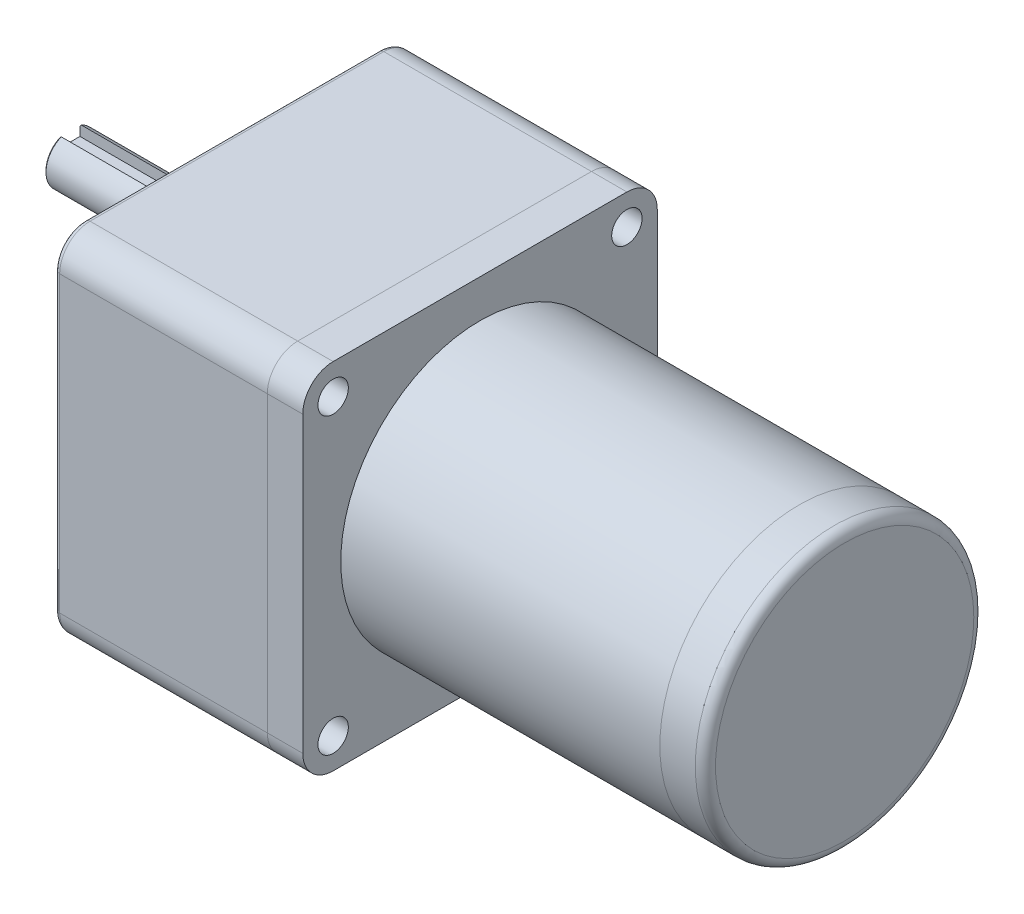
ISO-10303-21;
HEADER;
FILE_DESCRIPTION(('STEP AP214'),'2;1');
FILE_NAME('part.step','',(''),(''),'','','');
FILE_SCHEMA(('AUTOMOTIVE_DESIGN { 1 0 10303 214 1 1 1 1 }'));
ENDSEC;
DATA;
#1=APPLICATION_CONTEXT('core data for automotive mechanical design processes');
#2=APPLICATION_PROTOCOL_DEFINITION('international standard','automotive_design',2000,#1);
#3=PRODUCT_CONTEXT('',#1,'mechanical');
#4=PRODUCT('Part','Part','',(#3));
#5=PRODUCT_RELATED_PRODUCT_CATEGORY('part','',(#4));
#6=PRODUCT_DEFINITION_FORMATION('','',#4);
#7=PRODUCT_DEFINITION_CONTEXT('part definition',#1,'design');
#8=PRODUCT_DEFINITION('design','',#6,#7);
#9=PRODUCT_DEFINITION_SHAPE('','',#8);
#10=(LENGTH_UNIT() NAMED_UNIT(*) SI_UNIT(.MILLI.,.METRE.));
#11=(NAMED_UNIT(*) PLANE_ANGLE_UNIT() SI_UNIT($,.RADIAN.));
#12=(NAMED_UNIT(*) SI_UNIT($,.STERADIAN.) SOLID_ANGLE_UNIT());
#13=UNCERTAINTY_MEASURE_WITH_UNIT(LENGTH_MEASURE(1.E-05),#10,'distance_accuracy_value','');
#14=(GEOMETRIC_REPRESENTATION_CONTEXT(3) GLOBAL_UNCERTAINTY_ASSIGNED_CONTEXT((#13)) GLOBAL_UNIT_ASSIGNED_CONTEXT((#10,
#11,#12)) REPRESENTATION_CONTEXT('',''));
#15=CARTESIAN_POINT('',(0.,0.,0.));
#16=DIRECTION('',(0.,0.,1.));
#17=DIRECTION('',(1.,0.,0.));
#18=AXIS2_PLACEMENT_3D('',#15,#16,#17);
#19=CARTESIAN_POINT('',(-32.,15.,0.));
#20=DIRECTION('',(1.,0.,0.));
#21=DIRECTION('',(0.,0.,-1.));
#22=AXIS2_PLACEMENT_3D('',#19,#20,#21);
#23=CYLINDRICAL_SURFACE('',#22,5.);
#24=DIRECTION('',(1.,0.,0.));
#25=VECTOR('',#24,1.);
#26=CARTESIAN_POINT('',(-32.,19.5825756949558,2.));
#27=LINE('',#26,#25);
#28=CARTESIAN_POINT('',(-9.,19.5825756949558,2.));
#29=VERTEX_POINT('',#28);
#30=CARTESIAN_POINT('',(-31.7,19.5825756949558,2.));
#31=VERTEX_POINT('',#30);
#32=EDGE_CURVE('E132',#29,#31,#27,.F.);
#33=ORIENTED_EDGE('',*,*,#32,.T.);
#34=CARTESIAN_POINT('',(-31.7,15.,0.));
#35=DIRECTION('',(-1.,0.,0.));
#36=DIRECTION('',(0.,0.,1.));
#37=AXIS2_PLACEMENT_3D('',#34,#35,#36);
#38=CIRCLE('',#37,5.);
#39=CARTESIAN_POINT('',(-31.7,19.5825756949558,-2.));
#40=VERTEX_POINT('',#39);
#41=EDGE_CURVE('E60',#31,#40,#38,.F.);
#42=ORIENTED_EDGE('',*,*,#41,.T.);
#43=DIRECTION('',(1.,0.,0.));
#44=VECTOR('',#43,1.);
#45=CARTESIAN_POINT('',(-32.,19.5825756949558,-2.));
#46=LINE('',#45,#44);
#47=CARTESIAN_POINT('',(-9.,19.5825756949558,-2.));
#48=VERTEX_POINT('',#47);
#49=EDGE_CURVE('E127',#40,#48,#46,.T.);
#50=ORIENTED_EDGE('',*,*,#49,.T.);
#51=CARTESIAN_POINT('',(-9.,19.5825756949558,-2.));
#52=CARTESIAN_POINT('',(-8.94619414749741,19.5825646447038,-2.00000798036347));
#53=CARTESIAN_POINT('',(-8.89239433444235,19.5835230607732,-1.99782891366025));
#54=CARTESIAN_POINT('',(-8.7852287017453,19.5872962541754,-1.98915905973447));
#55=CARTESIAN_POINT('',(-8.73186272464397,19.5901103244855,-1.98266991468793));
#56=CARTESIAN_POINT('',(-8.62615317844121,19.5974978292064,-1.9654760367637));
#57=CARTESIAN_POINT('',(-8.57380641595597,19.6020643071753,-1.95478796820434));
#58=CARTESIAN_POINT('',(-8.47029922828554,19.6128005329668,-1.92931630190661));
#59=CARTESIAN_POINT('',(-8.41913887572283,19.618970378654,-1.91453245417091));
#60=CARTESIAN_POINT('',(-8.26806414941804,19.6395929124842,-1.86426971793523));
#61=CARTESIAN_POINT('',(-8.17034576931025,19.6561744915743,-1.82284489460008));
#62=CARTESIAN_POINT('',(-7.98320441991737,19.6931237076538,-1.72548191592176));
#63=CARTESIAN_POINT('',(-7.89378944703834,19.7134949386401,-1.66952996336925));
#64=CARTESIAN_POINT('',(-7.72073760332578,19.7570099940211,-1.54131835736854));
#65=CARTESIAN_POINT('',(-7.63763278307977,19.7802424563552,-1.4683691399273));
#66=CARTESIAN_POINT('',(-7.48445972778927,19.8261279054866,-1.30969646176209));
#67=CARTESIAN_POINT('',(-7.41439416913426,19.8487807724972,-1.22397038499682));
#68=CARTESIAN_POINT('',(-7.28659360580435,19.8920341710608,-1.03800590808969));
#69=CARTESIAN_POINT('',(-7.22945519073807,19.9125182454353,-0.937327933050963));
#70=CARTESIAN_POINT('',(-7.13315592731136,19.94803944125,-0.726824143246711));
#71=CARTESIAN_POINT('',(-7.09398757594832,19.9630788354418,-0.617002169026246));
#72=CARTESIAN_POINT('',(-7.03665879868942,19.9853831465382,-0.396967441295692));
#73=CARTESIAN_POINT('',(-7.01757304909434,19.9929892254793,-0.287031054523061));
#74=CARTESIAN_POINT('',(-6.99797152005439,20.0008031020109,-0.0652684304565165));
#75=CARTESIAN_POINT('',(-6.99744916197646,20.0010135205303,0.0465571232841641));
#76=CARTESIAN_POINT('',(-7.01448283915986,19.994219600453,0.262233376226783));
#77=CARTESIAN_POINT('',(-7.03102504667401,19.9876198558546,0.36617920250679));
#78=CARTESIAN_POINT('',(-7.07999342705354,19.9684927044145,0.569674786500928));
#79=CARTESIAN_POINT('',(-7.11242049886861,19.9559649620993,0.669224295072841));
#80=CARTESIAN_POINT('',(-7.19263629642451,19.9259683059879,0.862897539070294));
#81=CARTESIAN_POINT('',(-7.24064924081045,19.9084277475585,0.956916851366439));
#82=CARTESIAN_POINT('',(-7.35046458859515,19.8701460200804,1.13580746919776));
#83=CARTESIAN_POINT('',(-7.41227182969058,19.8494037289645,1.22067554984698));
#84=CARTESIAN_POINT('',(-7.55264418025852,19.8052178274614,1.38476339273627));
#85=CARTESIAN_POINT('',(-7.63204247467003,19.7816862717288,1.46324770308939));
#86=CARTESIAN_POINT('',(-7.80298009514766,19.7356195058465,1.60609926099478));
#87=CARTESIAN_POINT('',(-7.89452492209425,19.7130847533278,1.67046007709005));
#88=CARTESIAN_POINT('',(-8.09047028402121,19.6709568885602,1.78493657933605));
#89=CARTESIAN_POINT('',(-8.1951648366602,19.6514670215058,1.83458932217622));
#90=CARTESIAN_POINT('',(-8.41236152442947,19.6188610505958,1.91521298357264));
#91=CARTESIAN_POINT('',(-8.52484944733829,19.6057336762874,1.94621696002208));
#92=CARTESIAN_POINT('',(-8.69874363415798,19.5920830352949,1.9781058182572));
#93=CARTESIAN_POINT('',(-8.75865754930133,19.5885343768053,1.98630505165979));
#94=CARTESIAN_POINT('',(-8.87903501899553,19.5837754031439,1.99725282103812));
#95=CARTESIAN_POINT('',(-8.93949821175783,19.5825636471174,2.00000471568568));
#96=CARTESIAN_POINT('',(-9.,19.5825756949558,2.));
#97=B_SPLINE_CURVE_WITH_KNOTS('',3,(#51,#52,#53,#54,#55,#56,#57,#58,#59,#60,#61,#62,#63,#64,#65,
#66,#67,#68,#69,#70,#71,#72,#73,#74,#75,#76,#77,#78,#79,#80,#81,#82,#83,#84,#85,#86,#87,#88,#89,
#90,#91,#92,#93,#94,#95,#96),.UNSPECIFIED.,.F.,.F.,(4,2,2,2,2,2,2,2,2,2,2,2,2,2,2,2,2,2,2,2,2,2,
4),(0.,0.161354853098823,0.322648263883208,0.483307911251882,0.643977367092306,
0.964683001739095,1.28569434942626,1.62318047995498,1.96073580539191,2.31162858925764,
2.66237473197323,2.9961387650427,3.32978451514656,3.64468915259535,3.95961161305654,
4.27928176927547,4.59906421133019,4.93981874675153,5.28072813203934,5.63144241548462,
5.98153315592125,6.16300192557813,6.3443587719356),.UNSPECIFIED.);
#98=EDGE_CURVE('E106',#48,#29,#97,.T.);
#99=ORIENTED_EDGE('',*,*,#98,.T.);
#100=EDGE_LOOP('',(#33,#42,#50,#99));
#101=FACE_BOUND('',#100,.T.);
#102=CARTESIAN_POINT('',(-3.,15.,0.));
#103=DIRECTION('',(-1.,0.,0.));
#104=DIRECTION('',(0.,0.,1.));
#105=AXIS2_PLACEMENT_3D('',#102,#103,#104);
#106=CIRCLE('',#105,5.);
#107=CARTESIAN_POINT('',(-3.,15.,5.));
#108=VERTEX_POINT('',#107);
#109=EDGE_CURVE('E134',#108,#108,#106,.T.);
#110=ORIENTED_EDGE('',*,*,#109,.T.);
#111=EDGE_LOOP('',(#110));
#112=FACE_BOUND('',#111,.T.);
#113=ADVANCED_FACE('F47',(#101,#112),#23,.T.);
#114=CARTESIAN_POINT('',(-32.,15.,0.));
#115=DIRECTION('',(-1.,0.,0.));
#116=DIRECTION('',(0.,0.,1.));
#117=AXIS2_PLACEMENT_3D('',#114,#115,#116);
#118=PLANE('',#117);
#119=DIRECTION('',(0.,1.,0.));
#120=VECTOR('',#119,1.);
#121=CARTESIAN_POINT('',(-32.,17.5,-2.));
#122=LINE('',#121,#120);
#123=CARTESIAN_POINT('',(-32.,17.5,-2.));
#124=VERTEX_POINT('',#123);
#125=CARTESIAN_POINT('',(-32.,19.2532340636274,-2.));
#126=VERTEX_POINT('',#125);
#127=EDGE_CURVE('E108',#124,#126,#122,.T.);
#128=ORIENTED_EDGE('',*,*,#127,.T.);
#129=CARTESIAN_POINT('',(-32.,15.,0.));
#130=DIRECTION('',(-1.,0.,0.));
#131=DIRECTION('',(0.,0.,1.));
#132=AXIS2_PLACEMENT_3D('',#129,#130,#131);
#133=CIRCLE('',#132,4.70000000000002);
#134=CARTESIAN_POINT('',(-32.,19.2532340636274,2.));
#135=VERTEX_POINT('',#134);
#136=EDGE_CURVE('E142',#126,#135,#133,.T.);
#137=ORIENTED_EDGE('',*,*,#136,.T.);
#138=DIRECTION('',(0.,1.,0.));
#139=VECTOR('',#138,1.);
#140=CARTESIAN_POINT('',(-32.,17.5,2.));
#141=LINE('',#140,#139);
#142=CARTESIAN_POINT('',(-32.,17.5,2.));
#143=VERTEX_POINT('',#142);
#144=EDGE_CURVE('E128',#143,#135,#141,.T.);
#145=ORIENTED_EDGE('',*,*,#144,.F.);
#146=DIRECTION('',(0.,0.,1.));
#147=VECTOR('',#146,1.);
#148=CARTESIAN_POINT('',(-32.,17.5,-2.));
#149=LINE('',#148,#147);
#150=EDGE_CURVE('E117',#124,#143,#149,.T.);
#151=ORIENTED_EDGE('',*,*,#150,.F.);
#152=EDGE_LOOP('',(#128,#137,#145,#151));
#153=FACE_BOUND('',#152,.T.);
#154=ADVANCED_FACE('F153',(#153),#118,.T.);
#155=CARTESIAN_POINT('',(-3.,15.,0.));
#156=DIRECTION('',(-1.,0.,0.));
#157=DIRECTION('',(0.,0.,1.));
#158=AXIS2_PLACEMENT_3D('',#155,#156,#157);
#159=PLANE('',#158);
#160=ORIENTED_EDGE('',*,*,#109,.F.);
#161=EDGE_LOOP('',(#160));
#162=FACE_BOUND('',#161,.T.);
#163=ADVANCED_FACE('F150',(#162),#159,.F.);
#164=CARTESIAN_POINT('',(-9.,17.5,0.));
#165=DIRECTION('',(0.,1.,0.));
#166=DIRECTION('',(0.,0.,1.));
#167=AXIS2_PLACEMENT_3D('',#164,#165,#166);
#168=CYLINDRICAL_SURFACE('',#167,2.);
#169=DIRECTION('',(0.,1.,0.));
#170=VECTOR('',#169,1.);
#171=CARTESIAN_POINT('',(-9.,17.5,-2.));
#172=LINE('',#171,#170);
#173=CARTESIAN_POINT('',(-9.,17.5,-2.));
#174=VERTEX_POINT('',#173);
#175=EDGE_CURVE('E98',#174,#48,#172,.T.);
#176=ORIENTED_EDGE('',*,*,#175,.F.);
#177=CARTESIAN_POINT('',(-9.,17.5,0.));
#178=DIRECTION('',(0.,1.,0.));
#179=DIRECTION('',(0.,0.,1.));
#180=AXIS2_PLACEMENT_3D('',#177,#178,#179);
#181=CIRCLE('',#180,2.);
#182=CARTESIAN_POINT('',(-9.,17.5,2.));
#183=VERTEX_POINT('',#182);
#184=EDGE_CURVE('E103',#183,#174,#181,.T.);
#185=ORIENTED_EDGE('',*,*,#184,.F.);
#186=DIRECTION('',(0.,1.,0.));
#187=VECTOR('',#186,1.);
#188=CARTESIAN_POINT('',(-9.,17.5,2.));
#189=LINE('',#188,#187);
#190=EDGE_CURVE('E125',#183,#29,#189,.T.);
#191=ORIENTED_EDGE('',*,*,#190,.T.);
#192=ORIENTED_EDGE('',*,*,#98,.F.);
#193=EDGE_LOOP('',(#176,#185,#191,#192));
#194=FACE_BOUND('',#193,.T.);
#195=ADVANCED_FACE('F100',(#194),#168,.F.);
#196=CARTESIAN_POINT('',(-32.,17.5,2.));
#197=DIRECTION('',(0.,0.,1.));
#198=DIRECTION('',(1.,0.,0.));
#199=AXIS2_PLACEMENT_3D('',#196,#197,#198);
#200=PLANE('',#199);
#201=ORIENTED_EDGE('',*,*,#144,.T.);
#202=CARTESIAN_POINT('',(-32.,19.2532340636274,2.));
#203=CARTESIAN_POINT('',(-31.950173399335,19.3082822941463,2.));
#204=CARTESIAN_POINT('',(-31.9002600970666,19.3632515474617,2.));
#205=CARTESIAN_POINT('',(-31.8002600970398,19.4730320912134,2.));
#206=CARTESIAN_POINT('',(-31.7501733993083,19.5278433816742,2.));
#207=CARTESIAN_POINT('',(-31.7,19.5825756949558,2.));
#208=B_SPLINE_CURVE_WITH_KNOTS('',3,(#202,#203,#204,#205,#206,#207),.UNSPECIFIED.,.F.,.F.,(4,2,
4),(0.,0.22274785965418,0.445495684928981),.UNSPECIFIED.);
#209=EDGE_CURVE('E74',#135,#31,#208,.T.);
#210=ORIENTED_EDGE('',*,*,#209,.T.);
#211=ORIENTED_EDGE('',*,*,#32,.F.);
#212=ORIENTED_EDGE('',*,*,#190,.F.);
#213=DIRECTION('',(1.,0.,0.));
#214=VECTOR('',#213,1.);
#215=CARTESIAN_POINT('',(-32.,17.5,2.));
#216=LINE('',#215,#214);
#217=EDGE_CURVE('E109',#143,#183,#216,.T.);
#218=ORIENTED_EDGE('',*,*,#217,.F.);
#219=EDGE_LOOP('',(#201,#210,#211,#212,#218));
#220=FACE_BOUND('',#219,.T.);
#221=ADVANCED_FACE('F149',(#220),#200,.F.);
#222=CARTESIAN_POINT('',(-9.,17.5,-2.));
#223=DIRECTION('',(0.,0.,-1.));
#224=DIRECTION('',(-1.,0.,0.));
#225=AXIS2_PLACEMENT_3D('',#222,#223,#224);
#226=PLANE('',#225);
#227=ORIENTED_EDGE('',*,*,#49,.F.);
#228=CARTESIAN_POINT('',(-31.7,19.5825756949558,-2.));
#229=CARTESIAN_POINT('',(-31.7501733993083,19.5278433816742,-2.));
#230=CARTESIAN_POINT('',(-31.8002600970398,19.4730320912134,-2.));
#231=CARTESIAN_POINT('',(-31.9002600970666,19.3632515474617,-2.));
#232=CARTESIAN_POINT('',(-31.950173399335,19.3082822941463,-2.));
#233=CARTESIAN_POINT('',(-32.,19.2532340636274,-2.));
#234=B_SPLINE_CURVE_WITH_KNOTS('',3,(#228,#229,#230,#231,#232,#233),.UNSPECIFIED.,.F.,.F.,(4,2,
4),(0.,0.2227478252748,0.445495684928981),.UNSPECIFIED.);
#235=EDGE_CURVE('E12',#40,#126,#234,.T.);
#236=ORIENTED_EDGE('',*,*,#235,.T.);
#237=ORIENTED_EDGE('',*,*,#127,.F.);
#238=DIRECTION('',(-1.,0.,0.));
#239=VECTOR('',#238,1.);
#240=CARTESIAN_POINT('',(-9.,17.5,-2.));
#241=LINE('',#240,#239);
#242=EDGE_CURVE('E112',#174,#124,#241,.T.);
#243=ORIENTED_EDGE('',*,*,#242,.F.);
#244=ORIENTED_EDGE('',*,*,#175,.T.);
#245=EDGE_LOOP('',(#227,#236,#237,#243,#244));
#246=FACE_BOUND('',#245,.T.);
#247=ADVANCED_FACE('F113',(#246),#226,.F.);
#248=CARTESIAN_POINT('',(-9.,17.5,0.));
#249=DIRECTION('',(0.,1.,0.));
#250=DIRECTION('',(0.,0.,1.));
#251=AXIS2_PLACEMENT_3D('',#248,#249,#250);
#252=PLANE('',#251);
#253=ORIENTED_EDGE('',*,*,#184,.T.);
#254=ORIENTED_EDGE('',*,*,#242,.T.);
#255=ORIENTED_EDGE('',*,*,#150,.T.);
#256=ORIENTED_EDGE('',*,*,#217,.T.);
#257=EDGE_LOOP('',(#253,#254,#255,#256));
#258=FACE_BOUND('',#257,.T.);
#259=ADVANCED_FACE('F119',(#258),#252,.T.);
#260=CARTESIAN_POINT('',(-32.,15.,0.));
#261=DIRECTION('',(1.,0.,0.));
#262=DIRECTION('',(0.,0.,-1.));
#263=AXIS2_PLACEMENT_3D('',#260,#261,#262);
#264=CONICAL_SURFACE('',#263,4.70000000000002,0.78539816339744);
#265=ORIENTED_EDGE('',*,*,#235,.F.);
#266=ORIENTED_EDGE('',*,*,#41,.F.);
#267=ORIENTED_EDGE('',*,*,#209,.F.);
#268=ORIENTED_EDGE('',*,*,#136,.F.);
#269=EDGE_LOOP('',(#265,#266,#267,#268));
#270=FACE_BOUND('',#269,.T.);
#271=ADVANCED_FACE('F49',(#270),#264,.T.);
#272=CLOSED_SHELL('',(#113,#154,#163,#195,#221,#247,#259,#271));
#273=MANIFOLD_SOLID_BREP('B2',#272);
#274=CARTESIAN_POINT('',(-3.,15.,0.));
#275=DIRECTION('',(1.,0.,0.));
#276=DIRECTION('',(0.,0.,-1.));
#277=AXIS2_PLACEMENT_3D('',#274,#275,#276);
#278=CYLINDRICAL_SURFACE('',#277,12.);
#279=CARTESIAN_POINT('',(-2.5,15.,0.));
#280=DIRECTION('',(-1.,0.,0.));
#281=DIRECTION('',(0.,0.,1.));
#282=AXIS2_PLACEMENT_3D('',#279,#280,#281);
#283=CIRCLE('',#282,12.);
#284=CARTESIAN_POINT('',(-2.5,15.,12.));
#285=VERTEX_POINT('',#284);
#286=EDGE_CURVE('E46',#285,#285,#283,.F.);
#287=ORIENTED_EDGE('',*,*,#286,.T.);
#288=EDGE_LOOP('',(#287));
#289=FACE_BOUND('',#288,.T.);
#290=CARTESIAN_POINT('',(0.,15.,0.));
#291=DIRECTION('',(-1.,0.,0.));
#292=DIRECTION('',(0.,0.,1.));
#293=AXIS2_PLACEMENT_3D('',#290,#291,#292);
#294=CIRCLE('',#293,12.);
#295=CARTESIAN_POINT('',(0.,15.,12.));
#296=VERTEX_POINT('',#295);
#297=EDGE_CURVE('E245',#296,#296,#294,.T.);
#298=ORIENTED_EDGE('',*,*,#297,.T.);
#299=EDGE_LOOP('',(#298));
#300=FACE_BOUND('',#299,.T.);
#301=ADVANCED_FACE('F234',(#289,#300),#278,.T.);
#302=CARTESIAN_POINT('',(-3.,15.,0.));
#303=DIRECTION('',(-1.,0.,0.));
#304=DIRECTION('',(0.,0.,1.));
#305=AXIS2_PLACEMENT_3D('',#302,#303,#304);
#306=PLANE('',#305);
#307=CARTESIAN_POINT('',(-3.,15.,0.));
#308=DIRECTION('',(-1.,0.,0.));
#309=DIRECTION('',(0.,0.,1.));
#310=AXIS2_PLACEMENT_3D('',#307,#308,#309);
#311=CIRCLE('',#310,11.5);
#312=CARTESIAN_POINT('',(-3.,15.,11.5));
#313=VERTEX_POINT('',#312);
#314=EDGE_CURVE('E241',#313,#313,#311,.T.);
#315=ORIENTED_EDGE('',*,*,#314,.T.);
#316=EDGE_LOOP('',(#315));
#317=FACE_BOUND('',#316,.T.);
#318=ADVANCED_FACE('F255',(#317),#306,.T.);
#319=CARTESIAN_POINT('',(0.,15.,0.));
#320=DIRECTION('',(-1.,0.,0.));
#321=DIRECTION('',(0.,0.,1.));
#322=AXIS2_PLACEMENT_3D('',#319,#320,#321);
#323=PLANE('',#322);
#324=ORIENTED_EDGE('',*,*,#297,.F.);
#325=EDGE_LOOP('',(#324));
#326=FACE_BOUND('',#325,.T.);
#327=ADVANCED_FACE('F253',(#326),#323,.F.);
#328=CARTESIAN_POINT('',(-2.5,15.,0.));
#329=DIRECTION('',(-1.,0.,0.));
#330=DIRECTION('',(0.,0.,1.));
#331=AXIS2_PLACEMENT_3D('',#328,#329,#330);
#332=TOROIDAL_SURFACE('',#331,11.5,0.5);
#333=ORIENTED_EDGE('',*,*,#286,.F.);
#334=EDGE_LOOP('',(#333));
#335=FACE_BOUND('',#334,.T.);
#336=ORIENTED_EDGE('',*,*,#314,.F.);
#337=EDGE_LOOP('',(#336));
#338=FACE_BOUND('',#337,.T.);
#339=ADVANCED_FACE('F236',(#335,#338),#332,.T.);
#340=CLOSED_SHELL('',(#301,#318,#327,#339));
#341=MANIFOLD_SOLID_BREP('B6',#340);
#342=CARTESIAN_POINT('',(121.,0.,0.));
#343=DIRECTION('',(-1.,0.,0.));
#344=DIRECTION('',(0.,0.,1.));
#345=AXIS2_PLACEMENT_3D('',#342,#343,#344);
#346=CYLINDRICAL_SURFACE('',#345,27.5);
#347=CARTESIAN_POINT('',(119.,0.,0.));
#348=DIRECTION('',(1.,0.,0.));
#349=DIRECTION('',(0.,0.,-1.));
#350=AXIS2_PLACEMENT_3D('',#347,#348,#349);
#351=CIRCLE('',#350,27.5);
#352=CARTESIAN_POINT('',(119.,0.,-27.5));
#353=VERTEX_POINT('',#352);
#354=EDGE_CURVE('E233',#353,#353,#351,.F.);
#355=ORIENTED_EDGE('',*,*,#354,.T.);
#356=EDGE_LOOP('',(#355));
#357=FACE_BOUND('',#356,.T.);
#358=CARTESIAN_POINT('',(112.,0.,0.));
#359=DIRECTION('',(1.,0.,0.));
#360=DIRECTION('',(0.,0.,-1.));
#361=AXIS2_PLACEMENT_3D('',#358,#359,#360);
#362=CIRCLE('',#361,27.5);
#363=CARTESIAN_POINT('',(112.,0.,-27.5));
#364=VERTEX_POINT('',#363);
#365=EDGE_CURVE('E308',#364,#364,#362,.T.);
#366=ORIENTED_EDGE('',*,*,#365,.T.);
#367=EDGE_LOOP('',(#366));
#368=FACE_BOUND('',#367,.T.);
#369=ADVANCED_FACE('F297',(#357,#368),#346,.T.);
#370=CARTESIAN_POINT('',(121.,0.,0.));
#371=DIRECTION('',(1.,0.,0.));
#372=DIRECTION('',(0.,0.,-1.));
#373=AXIS2_PLACEMENT_3D('',#370,#371,#372);
#374=PLANE('',#373);
#375=CARTESIAN_POINT('',(121.,0.,0.));
#376=DIRECTION('',(1.,0.,0.));
#377=DIRECTION('',(0.,0.,-1.));
#378=AXIS2_PLACEMENT_3D('',#375,#376,#377);
#379=CIRCLE('',#378,25.5);
#380=CARTESIAN_POINT('',(121.,0.,-25.5));
#381=VERTEX_POINT('',#380);
#382=EDGE_CURVE('E304',#381,#381,#379,.T.);
#383=ORIENTED_EDGE('',*,*,#382,.T.);
#384=EDGE_LOOP('',(#383));
#385=FACE_BOUND('',#384,.T.);
#386=ADVANCED_FACE('F318',(#385),#374,.T.);
#387=CARTESIAN_POINT('',(112.,0.,0.));
#388=DIRECTION('',(1.,0.,0.));
#389=DIRECTION('',(0.,0.,-1.));
#390=AXIS2_PLACEMENT_3D('',#387,#388,#389);
#391=PLANE('',#390);
#392=ORIENTED_EDGE('',*,*,#365,.F.);
#393=EDGE_LOOP('',(#392));
#394=FACE_BOUND('',#393,.T.);
#395=ADVANCED_FACE('F316',(#394),#391,.F.);
#396=CARTESIAN_POINT('',(119.,0.,0.));
#397=DIRECTION('',(1.,0.,0.));
#398=DIRECTION('',(0.,0.,-1.));
#399=AXIS2_PLACEMENT_3D('',#396,#397,#398);
#400=TOROIDAL_SURFACE('',#399,25.5,2.);
#401=ORIENTED_EDGE('',*,*,#354,.F.);
#402=EDGE_LOOP('',(#401));
#403=FACE_BOUND('',#402,.T.);
#404=ORIENTED_EDGE('',*,*,#382,.F.);
#405=EDGE_LOOP('',(#404));
#406=FACE_BOUND('',#405,.T.);
#407=ADVANCED_FACE('F299',(#403,#406),#400,.T.);
#408=CLOSED_SHELL('',(#369,#386,#395,#407));
#409=MANIFOLD_SOLID_BREP('B41',#408);
#410=CARTESIAN_POINT('',(112.,0.,0.));
#411=DIRECTION('',(-1.,0.,0.));
#412=DIRECTION('',(0.,0.,1.));
#413=AXIS2_PLACEMENT_3D('',#410,#411,#412);
#414=CYLINDRICAL_SURFACE('',#413,27.5);
#415=CARTESIAN_POINT('',(112.,0.,0.));
#416=DIRECTION('',(1.,0.,0.));
#417=DIRECTION('',(0.,0.,-1.));
#418=AXIS2_PLACEMENT_3D('',#415,#416,#417);
#419=CIRCLE('',#418,27.5);
#420=CARTESIAN_POINT('',(112.,0.,-27.5));
#421=VERTEX_POINT('',#420);
#422=EDGE_CURVE('E296',#421,#421,#419,.T.);
#423=ORIENTED_EDGE('',*,*,#422,.F.);
#424=EDGE_LOOP('',(#423));
#425=FACE_BOUND('',#424,.T.);
#426=CARTESIAN_POINT('',(49.,0.,0.));
#427=DIRECTION('',(1.,0.,0.));
#428=DIRECTION('',(0.,0.,-1.));
#429=AXIS2_PLACEMENT_3D('',#426,#427,#428);
#430=CIRCLE('',#429,27.5);
#431=CARTESIAN_POINT('',(49.,0.,-27.5));
#432=VERTEX_POINT('',#431);
#433=EDGE_CURVE('E365',#432,#432,#430,.T.);
#434=ORIENTED_EDGE('',*,*,#433,.T.);
#435=EDGE_LOOP('',(#434));
#436=FACE_BOUND('',#435,.T.);
#437=ADVANCED_FACE('F362',(#425,#436),#414,.T.);
#438=CARTESIAN_POINT('',(112.,0.,0.));
#439=DIRECTION('',(1.,0.,0.));
#440=DIRECTION('',(0.,0.,-1.));
#441=AXIS2_PLACEMENT_3D('',#438,#439,#440);
#442=PLANE('',#441);
#443=ORIENTED_EDGE('',*,*,#422,.T.);
#444=EDGE_LOOP('',(#443));
#445=FACE_BOUND('',#444,.T.);
#446=ADVANCED_FACE('F377',(#445),#442,.T.);
#447=CARTESIAN_POINT('',(49.,0.,0.));
#448=DIRECTION('',(1.,0.,0.));
#449=DIRECTION('',(0.,0.,-1.));
#450=AXIS2_PLACEMENT_3D('',#447,#448,#449);
#451=PLANE('',#450);
#452=ORIENTED_EDGE('',*,*,#433,.F.);
#453=EDGE_LOOP('',(#452));
#454=FACE_BOUND('',#453,.T.);
#455=ADVANCED_FACE('F375',(#454),#451,.F.);
#456=CLOSED_SHELL('',(#437,#446,#455));
#457=MANIFOLD_SOLID_BREP('B228',#456);
#458=CARTESIAN_POINT('',(49.,29.,-29.));
#459=DIRECTION('',(-1.,0.,0.));
#460=DIRECTION('',(0.,0.,1.));
#461=AXIS2_PLACEMENT_3D('',#458,#459,#460);
#462=CYLINDRICAL_SURFACE('',#461,6.);
#463=CARTESIAN_POINT('',(42.,29.,-29.));
#464=DIRECTION('',(1.,0.,0.));
#465=DIRECTION('',(0.,0.,1.));
#466=AXIS2_PLACEMENT_3D('',#463,#464,#465);
#467=CIRCLE('',#466,6.);
#468=CARTESIAN_POINT('',(42.,29.,-35.));
#469=VERTEX_POINT('',#468);
#470=CARTESIAN_POINT('',(42.,35.,-29.));
#471=VERTEX_POINT('',#470);
#472=EDGE_CURVE('E509',#469,#471,#467,.T.);
#473=ORIENTED_EDGE('',*,*,#472,.T.);
#474=DIRECTION('',(-1.,0.,0.));
#475=VECTOR('',#474,1.);
#476=CARTESIAN_POINT('',(49.,35.,-29.));
#477=LINE('',#476,#475);
#478=CARTESIAN_POINT('',(49.,35.,-29.));
#479=VERTEX_POINT('',#478);
#480=EDGE_CURVE('E360',#479,#471,#477,.T.);
#481=ORIENTED_EDGE('',*,*,#480,.F.);
#482=CARTESIAN_POINT('',(49.,29.,-29.));
#483=DIRECTION('',(1.,0.,0.));
#484=DIRECTION('',(0.,0.,1.));
#485=AXIS2_PLACEMENT_3D('',#482,#483,#484);
#486=CIRCLE('',#485,6.);
#487=CARTESIAN_POINT('',(49.,29.,-35.));
#488=VERTEX_POINT('',#487);
#489=EDGE_CURVE('E523',#488,#479,#486,.T.);
#490=ORIENTED_EDGE('',*,*,#489,.F.);
#491=DIRECTION('',(-1.,0.,0.));
#492=VECTOR('',#491,1.);
#493=CARTESIAN_POINT('',(49.,29.,-35.));
#494=LINE('',#493,#492);
#495=EDGE_CURVE('E505',#488,#469,#494,.T.);
#496=ORIENTED_EDGE('',*,*,#495,.T.);
#497=EDGE_LOOP('',(#473,#481,#490,#496));
#498=FACE_BOUND('',#497,.T.);
#499=ADVANCED_FACE('F411',(#498),#462,.T.);
#500=CARTESIAN_POINT('',(49.,35.,29.));
#501=DIRECTION('',(0.,-1.,0.));
#502=DIRECTION('',(0.,0.,-1.));
#503=AXIS2_PLACEMENT_3D('',#500,#501,#502);
#504=PLANE('',#503);
#505=DIRECTION('',(0.,0.,1.));
#506=VECTOR('',#505,1.);
#507=CARTESIAN_POINT('',(42.,35.,29.));
#508=LINE('',#507,#506);
#509=CARTESIAN_POINT('',(42.,35.,29.));
#510=VERTEX_POINT('',#509);
#511=EDGE_CURVE('E512',#471,#510,#508,.T.);
#512=ORIENTED_EDGE('',*,*,#511,.T.);
#513=DIRECTION('',(-1.,0.,0.));
#514=VECTOR('',#513,1.);
#515=CARTESIAN_POINT('',(49.,35.,29.));
#516=LINE('',#515,#514);
#517=CARTESIAN_POINT('',(49.,35.,29.));
#518=VERTEX_POINT('',#517);
#519=EDGE_CURVE('E420',#518,#510,#516,.T.);
#520=ORIENTED_EDGE('',*,*,#519,.F.);
#521=DIRECTION('',(0.,0.,1.));
#522=VECTOR('',#521,1.);
#523=CARTESIAN_POINT('',(49.,35.,29.));
#524=LINE('',#523,#522);
#525=EDGE_CURVE('E472',#479,#518,#524,.T.);
#526=ORIENTED_EDGE('',*,*,#525,.F.);
#527=ORIENTED_EDGE('',*,*,#480,.T.);
#528=EDGE_LOOP('',(#512,#520,#526,#527));
#529=FACE_BOUND('',#528,.T.);
#530=ADVANCED_FACE('F577',(#529),#504,.F.);
#531=CARTESIAN_POINT('',(49.,29.,29.));
#532=DIRECTION('',(-1.,0.,0.));
#533=DIRECTION('',(0.,0.,1.));
#534=AXIS2_PLACEMENT_3D('',#531,#532,#533);
#535=CYLINDRICAL_SURFACE('',#534,6.);
#536=CARTESIAN_POINT('',(42.,29.,29.));
#537=DIRECTION('',(1.,0.,0.));
#538=DIRECTION('',(0.,0.,1.));
#539=AXIS2_PLACEMENT_3D('',#536,#537,#538);
#540=CIRCLE('',#539,6.);
#541=CARTESIAN_POINT('',(42.,29.,35.));
#542=VERTEX_POINT('',#541);
#543=EDGE_CURVE('E514',#510,#542,#540,.T.);
#544=ORIENTED_EDGE('',*,*,#543,.T.);
#545=DIRECTION('',(-1.,0.,0.));
#546=VECTOR('',#545,1.);
#547=CARTESIAN_POINT('',(49.,29.,35.));
#548=LINE('',#547,#546);
#549=CARTESIAN_POINT('',(49.,29.,35.));
#550=VERTEX_POINT('',#549);
#551=EDGE_CURVE('E530',#550,#542,#548,.T.);
#552=ORIENTED_EDGE('',*,*,#551,.F.);
#553=CARTESIAN_POINT('',(49.,29.,29.));
#554=DIRECTION('',(1.,0.,0.));
#555=DIRECTION('',(0.,0.,1.));
#556=AXIS2_PLACEMENT_3D('',#553,#554,#555);
#557=CIRCLE('',#556,6.);
#558=EDGE_CURVE('E678',#518,#550,#557,.T.);
#559=ORIENTED_EDGE('',*,*,#558,.F.);
#560=ORIENTED_EDGE('',*,*,#519,.T.);
#561=EDGE_LOOP('',(#544,#552,#559,#560));
#562=FACE_BOUND('',#561,.T.);
#563=ADVANCED_FACE('F581',(#562),#535,.T.);
#564=CARTESIAN_POINT('',(49.,-29.,35.));
#565=DIRECTION('',(0.,0.,-1.));
#566=DIRECTION('',(-1.,0.,0.));
#567=AXIS2_PLACEMENT_3D('',#564,#565,#566);
#568=PLANE('',#567);
#569=DIRECTION('',(0.,-1.,0.));
#570=VECTOR('',#569,1.);
#571=CARTESIAN_POINT('',(42.,-29.,35.));
#572=LINE('',#571,#570);
#573=CARTESIAN_POINT('',(42.,-29.,35.));
#574=VERTEX_POINT('',#573);
#575=EDGE_CURVE('E516',#542,#574,#572,.T.);
#576=ORIENTED_EDGE('',*,*,#575,.T.);
#577=DIRECTION('',(-1.,0.,0.));
#578=VECTOR('',#577,1.);
#579=CARTESIAN_POINT('',(49.,-29.,35.));
#580=LINE('',#579,#578);
#581=CARTESIAN_POINT('',(49.,-29.,35.));
#582=VERTEX_POINT('',#581);
#583=EDGE_CURVE('E527',#582,#574,#580,.T.);
#584=ORIENTED_EDGE('',*,*,#583,.F.);
#585=DIRECTION('',(0.,-1.,0.));
#586=VECTOR('',#585,1.);
#587=CARTESIAN_POINT('',(49.,-29.,35.));
#588=LINE('',#587,#586);
#589=EDGE_CURVE('E680',#550,#582,#588,.T.);
#590=ORIENTED_EDGE('',*,*,#589,.F.);
#591=ORIENTED_EDGE('',*,*,#551,.T.);
#592=EDGE_LOOP('',(#576,#584,#590,#591));
#593=FACE_BOUND('',#592,.T.);
#594=ADVANCED_FACE('F585',(#593),#568,.F.);
#595=CARTESIAN_POINT('',(49.,-29.,29.));
#596=DIRECTION('',(-1.,0.,0.));
#597=DIRECTION('',(0.,0.,1.));
#598=AXIS2_PLACEMENT_3D('',#595,#596,#597);
#599=CYLINDRICAL_SURFACE('',#598,6.);
#600=CARTESIAN_POINT('',(42.,-29.,29.));
#601=DIRECTION('',(1.,0.,0.));
#602=DIRECTION('',(0.,0.,1.));
#603=AXIS2_PLACEMENT_3D('',#600,#601,#602);
#604=CIRCLE('',#603,6.);
#605=CARTESIAN_POINT('',(42.,-35.,29.));
#606=VERTEX_POINT('',#605);
#607=EDGE_CURVE('E518',#574,#606,#604,.T.);
#608=ORIENTED_EDGE('',*,*,#607,.T.);
#609=DIRECTION('',(-1.,0.,0.));
#610=VECTOR('',#609,1.);
#611=CARTESIAN_POINT('',(49.,-35.,29.));
#612=LINE('',#611,#610);
#613=CARTESIAN_POINT('',(49.,-35.,29.));
#614=VERTEX_POINT('',#613);
#615=EDGE_CURVE('E500',#614,#606,#612,.T.);
#616=ORIENTED_EDGE('',*,*,#615,.F.);
#617=CARTESIAN_POINT('',(49.,-29.,29.));
#618=DIRECTION('',(1.,0.,0.));
#619=DIRECTION('',(0.,0.,1.));
#620=AXIS2_PLACEMENT_3D('',#617,#618,#619);
#621=CIRCLE('',#620,6.);
#622=EDGE_CURVE('E491',#582,#614,#621,.T.);
#623=ORIENTED_EDGE('',*,*,#622,.F.);
#624=ORIENTED_EDGE('',*,*,#583,.T.);
#625=EDGE_LOOP('',(#608,#616,#623,#624));
#626=FACE_BOUND('',#625,.T.);
#627=ADVANCED_FACE('F591',(#626),#599,.T.);
#628=CARTESIAN_POINT('',(49.,-35.,29.));
#629=DIRECTION('',(0.,1.,0.));
#630=DIRECTION('',(0.,0.,1.));
#631=AXIS2_PLACEMENT_3D('',#628,#629,#630);
#632=PLANE('',#631);
#633=DIRECTION('',(0.,0.,-1.));
#634=VECTOR('',#633,1.);
#635=CARTESIAN_POINT('',(42.,-35.,29.));
#636=LINE('',#635,#634);
#637=CARTESIAN_POINT('',(42.,-35.,-29.));
#638=VERTEX_POINT('',#637);
#639=EDGE_CURVE('E499',#606,#638,#636,.T.);
#640=ORIENTED_EDGE('',*,*,#639,.T.);
#641=DIRECTION('',(-1.,0.,0.));
#642=VECTOR('',#641,1.);
#643=CARTESIAN_POINT('',(49.,-35.,-29.));
#644=LINE('',#643,#642);
#645=CARTESIAN_POINT('',(49.,-35.,-29.));
#646=VERTEX_POINT('',#645);
#647=EDGE_CURVE('E496',#646,#638,#644,.T.);
#648=ORIENTED_EDGE('',*,*,#647,.F.);
#649=DIRECTION('',(0.,0.,-1.));
#650=VECTOR('',#649,1.);
#651=CARTESIAN_POINT('',(49.,-35.,29.));
#652=LINE('',#651,#650);
#653=EDGE_CURVE('E485',#614,#646,#652,.T.);
#654=ORIENTED_EDGE('',*,*,#653,.F.);
#655=ORIENTED_EDGE('',*,*,#615,.T.);
#656=EDGE_LOOP('',(#640,#648,#654,#655));
#657=FACE_BOUND('',#656,.T.);
#658=ADVANCED_FACE('F497',(#657),#632,.F.);
#659=CARTESIAN_POINT('',(49.,-29.,-29.));
#660=DIRECTION('',(-1.,0.,0.));
#661=DIRECTION('',(0.,0.,1.));
#662=AXIS2_PLACEMENT_3D('',#659,#660,#661);
#663=CYLINDRICAL_SURFACE('',#662,6.);
#664=CARTESIAN_POINT('',(42.,-29.,-29.));
#665=DIRECTION('',(1.,0.,0.));
#666=DIRECTION('',(0.,0.,-1.));
#667=AXIS2_PLACEMENT_3D('',#664,#665,#666);
#668=CIRCLE('',#667,6.);
#669=CARTESIAN_POINT('',(42.,-29.,-35.));
#670=VERTEX_POINT('',#669);
#671=EDGE_CURVE('E458',#638,#670,#668,.T.);
#672=ORIENTED_EDGE('',*,*,#671,.T.);
#673=DIRECTION('',(-1.,0.,0.));
#674=VECTOR('',#673,1.);
#675=CARTESIAN_POINT('',(49.,-29.,-35.));
#676=LINE('',#675,#674);
#677=CARTESIAN_POINT('',(49.,-29.,-35.));
#678=VERTEX_POINT('',#677);
#679=EDGE_CURVE('E501',#678,#670,#676,.T.);
#680=ORIENTED_EDGE('',*,*,#679,.F.);
#681=CARTESIAN_POINT('',(49.,-29.,-29.));
#682=DIRECTION('',(1.,0.,0.));
#683=DIRECTION('',(0.,0.,-1.));
#684=AXIS2_PLACEMENT_3D('',#681,#682,#683);
#685=CIRCLE('',#684,6.);
#686=EDGE_CURVE('E489',#646,#678,#685,.T.);
#687=ORIENTED_EDGE('',*,*,#686,.F.);
#688=ORIENTED_EDGE('',*,*,#647,.T.);
#689=EDGE_LOOP('',(#672,#680,#687,#688));
#690=FACE_BOUND('',#689,.T.);
#691=ADVANCED_FACE('F503',(#690),#663,.T.);
#692=CARTESIAN_POINT('',(49.,-29.,-35.));
#693=DIRECTION('',(0.,0.,1.));
#694=DIRECTION('',(1.,0.,0.));
#695=AXIS2_PLACEMENT_3D('',#692,#693,#694);
#696=PLANE('',#695);
#697=DIRECTION('',(0.,1.,0.));
#698=VECTOR('',#697,1.);
#699=CARTESIAN_POINT('',(42.,-29.,-35.));
#700=LINE('',#699,#698);
#701=EDGE_CURVE('E464',#670,#469,#700,.T.);
#702=ORIENTED_EDGE('',*,*,#701,.T.);
#703=ORIENTED_EDGE('',*,*,#495,.F.);
#704=DIRECTION('',(0.,1.,0.));
#705=VECTOR('',#704,1.);
#706=CARTESIAN_POINT('',(49.,-29.,-35.));
#707=LINE('',#706,#705);
#708=EDGE_CURVE('E429',#678,#488,#707,.T.);
#709=ORIENTED_EDGE('',*,*,#708,.F.);
#710=ORIENTED_EDGE('',*,*,#679,.T.);
#711=EDGE_LOOP('',(#702,#703,#709,#710));
#712=FACE_BOUND('',#711,.T.);
#713=ADVANCED_FACE('F566',(#712),#696,.F.);
#714=CARTESIAN_POINT('',(49.,29.,-29.));
#715=DIRECTION('',(-1.,0.,0.));
#716=DIRECTION('',(0.,0.,1.));
#717=AXIS2_PLACEMENT_3D('',#714,#715,#716);
#718=PLANE('',#717);
#719=CARTESIAN_POINT('',(49.,29.,29.));
#720=DIRECTION('',(1.,0.,0.));
#721=DIRECTION('',(0.,0.,-1.));
#722=AXIS2_PLACEMENT_3D('',#719,#720,#721);
#723=CIRCLE('',#722,3.);
#724=CARTESIAN_POINT('',(49.,29.,26.));
#725=VERTEX_POINT('',#724);
#726=EDGE_CURVE('E539',#725,#725,#723,.T.);
#727=ORIENTED_EDGE('',*,*,#726,.F.);
#728=EDGE_LOOP('',(#727));
#729=FACE_BOUND('',#728,.T.);
#730=CARTESIAN_POINT('',(49.,29.,-29.));
#731=DIRECTION('',(1.,0.,0.));
#732=DIRECTION('',(0.,0.,-1.));
#733=AXIS2_PLACEMENT_3D('',#730,#731,#732);
#734=CIRCLE('',#733,3.);
#735=CARTESIAN_POINT('',(49.,29.,-32.));
#736=VERTEX_POINT('',#735);
#737=EDGE_CURVE('E664',#736,#736,#734,.T.);
#738=ORIENTED_EDGE('',*,*,#737,.F.);
#739=EDGE_LOOP('',(#738));
#740=FACE_BOUND('',#739,.T.);
#741=CARTESIAN_POINT('',(49.,-29.,-29.));
#742=DIRECTION('',(1.,0.,0.));
#743=DIRECTION('',(0.,0.,-1.));
#744=AXIS2_PLACEMENT_3D('',#741,#742,#743);
#745=CIRCLE('',#744,3.);
#746=CARTESIAN_POINT('',(49.,-29.,-32.));
#747=VERTEX_POINT('',#746);
#748=EDGE_CURVE('E666',#747,#747,#745,.T.);
#749=ORIENTED_EDGE('',*,*,#748,.F.);
#750=EDGE_LOOP('',(#749));
#751=FACE_BOUND('',#750,.T.);
#752=CARTESIAN_POINT('',(49.,-29.,29.));
#753=DIRECTION('',(1.,0.,0.));
#754=DIRECTION('',(0.,0.,-1.));
#755=AXIS2_PLACEMENT_3D('',#752,#753,#754);
#756=CIRCLE('',#755,3.);
#757=CARTESIAN_POINT('',(49.,-29.,26.));
#758=VERTEX_POINT('',#757);
#759=EDGE_CURVE('E671',#758,#758,#756,.T.);
#760=ORIENTED_EDGE('',*,*,#759,.F.);
#761=EDGE_LOOP('',(#760));
#762=FACE_BOUND('',#761,.T.);
#763=ORIENTED_EDGE('',*,*,#489,.T.);
#764=ORIENTED_EDGE('',*,*,#525,.T.);
#765=ORIENTED_EDGE('',*,*,#558,.T.);
#766=ORIENTED_EDGE('',*,*,#589,.T.);
#767=ORIENTED_EDGE('',*,*,#622,.T.);
#768=ORIENTED_EDGE('',*,*,#653,.T.);
#769=ORIENTED_EDGE('',*,*,#686,.T.);
#770=ORIENTED_EDGE('',*,*,#708,.T.);
#771=EDGE_LOOP('',(#763,#764,#765,#766,#767,#768,#769,#770));
#772=FACE_BOUND('',#771,.T.);
#773=ADVANCED_FACE('F487',(#729,#740,#751,#762,#772),#718,.F.);
#774=CARTESIAN_POINT('',(42.,29.,-29.));
#775=DIRECTION('',(-1.,0.,0.));
#776=DIRECTION('',(0.,0.,1.));
#777=AXIS2_PLACEMENT_3D('',#774,#775,#776);
#778=PLANE('',#777);
#779=CARTESIAN_POINT('',(42.,29.,29.));
#780=DIRECTION('',(-1.,0.,0.));
#781=DIRECTION('',(0.,0.,1.));
#782=AXIS2_PLACEMENT_3D('',#779,#780,#781);
#783=CIRCLE('',#782,3.);
#784=CARTESIAN_POINT('',(42.,29.,32.));
#785=VERTEX_POINT('',#784);
#786=EDGE_CURVE('E414',#785,#785,#783,.T.);
#787=ORIENTED_EDGE('',*,*,#786,.F.);
#788=EDGE_LOOP('',(#787));
#789=FACE_BOUND('',#788,.T.);
#790=CARTESIAN_POINT('',(42.,29.,-29.));
#791=DIRECTION('',(-1.,0.,0.));
#792=DIRECTION('',(0.,0.,1.));
#793=AXIS2_PLACEMENT_3D('',#790,#791,#792);
#794=CIRCLE('',#793,3.);
#795=CARTESIAN_POINT('',(42.,29.,-26.));
#796=VERTEX_POINT('',#795);
#797=EDGE_CURVE('E541',#796,#796,#794,.T.);
#798=ORIENTED_EDGE('',*,*,#797,.F.);
#799=EDGE_LOOP('',(#798));
#800=FACE_BOUND('',#799,.T.);
#801=CARTESIAN_POINT('',(42.,-29.,-29.));
#802=DIRECTION('',(-1.,0.,0.));
#803=DIRECTION('',(0.,0.,1.));
#804=AXIS2_PLACEMENT_3D('',#801,#802,#803);
#805=CIRCLE('',#804,3.);
#806=CARTESIAN_POINT('',(42.,-29.,-26.));
#807=VERTEX_POINT('',#806);
#808=EDGE_CURVE('E538',#807,#807,#805,.T.);
#809=ORIENTED_EDGE('',*,*,#808,.F.);
#810=EDGE_LOOP('',(#809));
#811=FACE_BOUND('',#810,.T.);
#812=CARTESIAN_POINT('',(42.,-29.,29.));
#813=DIRECTION('',(-1.,0.,0.));
#814=DIRECTION('',(0.,0.,1.));
#815=AXIS2_PLACEMENT_3D('',#812,#813,#814);
#816=CIRCLE('',#815,3.);
#817=CARTESIAN_POINT('',(42.,-29.,32.));
#818=VERTEX_POINT('',#817);
#819=EDGE_CURVE('E535',#818,#818,#816,.T.);
#820=ORIENTED_EDGE('',*,*,#819,.F.);
#821=EDGE_LOOP('',(#820));
#822=FACE_BOUND('',#821,.T.);
#823=ORIENTED_EDGE('',*,*,#472,.F.);
#824=ORIENTED_EDGE('',*,*,#701,.F.);
#825=ORIENTED_EDGE('',*,*,#671,.F.);
#826=ORIENTED_EDGE('',*,*,#639,.F.);
#827=ORIENTED_EDGE('',*,*,#607,.F.);
#828=ORIENTED_EDGE('',*,*,#575,.F.);
#829=ORIENTED_EDGE('',*,*,#543,.F.);
#830=ORIENTED_EDGE('',*,*,#511,.F.);
#831=EDGE_LOOP('',(#823,#824,#825,#826,#827,#828,#829,#830));
#832=FACE_BOUND('',#831,.T.);
#833=ADVANCED_FACE('F551',(#789,#800,#811,#822,#832),#778,.T.);
#834=CARTESIAN_POINT('',(14.,-29.,29.));
#835=DIRECTION('',(1.,0.,0.));
#836=DIRECTION('',(0.,0.,-1.));
#837=AXIS2_PLACEMENT_3D('',#834,#835,#836);
#838=CYLINDRICAL_SURFACE('',#837,3.);
#839=ORIENTED_EDGE('',*,*,#819,.T.);
#840=EDGE_LOOP('',(#839));
#841=FACE_BOUND('',#840,.T.);
#842=ORIENTED_EDGE('',*,*,#759,.T.);
#843=EDGE_LOOP('',(#842));
#844=FACE_BOUND('',#843,.T.);
#845=ADVANCED_FACE('F554',(#841,#844),#838,.F.);
#846=CARTESIAN_POINT('',(14.,-29.,-29.));
#847=DIRECTION('',(1.,0.,0.));
#848=DIRECTION('',(0.,0.,-1.));
#849=AXIS2_PLACEMENT_3D('',#846,#847,#848);
#850=CYLINDRICAL_SURFACE('',#849,3.);
#851=ORIENTED_EDGE('',*,*,#808,.T.);
#852=EDGE_LOOP('',(#851));
#853=FACE_BOUND('',#852,.T.);
#854=ORIENTED_EDGE('',*,*,#748,.T.);
#855=EDGE_LOOP('',(#854));
#856=FACE_BOUND('',#855,.T.);
#857=ADVANCED_FACE('F630',(#853,#856),#850,.F.);
#858=CARTESIAN_POINT('',(14.,29.,-29.));
#859=DIRECTION('',(1.,0.,0.));
#860=DIRECTION('',(0.,0.,-1.));
#861=AXIS2_PLACEMENT_3D('',#858,#859,#860);
#862=CYLINDRICAL_SURFACE('',#861,3.);
#863=ORIENTED_EDGE('',*,*,#797,.T.);
#864=EDGE_LOOP('',(#863));
#865=FACE_BOUND('',#864,.T.);
#866=ORIENTED_EDGE('',*,*,#737,.T.);
#867=EDGE_LOOP('',(#866));
#868=FACE_BOUND('',#867,.T.);
#869=ADVANCED_FACE('F640',(#865,#868),#862,.F.);
#870=CARTESIAN_POINT('',(14.,29.,29.));
#871=DIRECTION('',(1.,0.,0.));
#872=DIRECTION('',(0.,0.,-1.));
#873=AXIS2_PLACEMENT_3D('',#870,#871,#872);
#874=CYLINDRICAL_SURFACE('',#873,3.);
#875=ORIENTED_EDGE('',*,*,#786,.T.);
#876=EDGE_LOOP('',(#875));
#877=FACE_BOUND('',#876,.T.);
#878=ORIENTED_EDGE('',*,*,#726,.T.);
#879=EDGE_LOOP('',(#878));
#880=FACE_BOUND('',#879,.T.);
#881=ADVANCED_FACE('F548',(#877,#880),#874,.F.);
#882=CLOSED_SHELL('',(#499,#530,#563,#594,#627,#658,#691,#713,#773,#833,#845,#857,#869,#881));
#883=MANIFOLD_SOLID_BREP('B291',#882);
#884=CARTESIAN_POINT('',(42.,-29.,29.));
#885=DIRECTION('',(-1.,0.,0.));
#886=DIRECTION('',(0.,0.,1.));
#887=AXIS2_PLACEMENT_3D('',#884,#885,#886);
#888=CYLINDRICAL_SURFACE('',#887,6.);
#889=DIRECTION('',(-1.,0.,0.));
#890=VECTOR('',#889,1.);
#891=CARTESIAN_POINT('',(42.,-29.,35.));
#892=LINE('',#891,#890);
#893=CARTESIAN_POINT('',(42.,-29.,35.));
#894=VERTEX_POINT('',#893);
#895=CARTESIAN_POINT('',(1.00000000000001,-29.,35.));
#896=VERTEX_POINT('',#895);
#897=EDGE_CURVE('E931',#894,#896,#892,.T.);
#898=ORIENTED_EDGE('',*,*,#897,.T.);
#899=CARTESIAN_POINT('',(1.,-29.,29.));
#900=DIRECTION('',(-1.,0.,0.));
#901=DIRECTION('',(0.,0.,1.));
#902=AXIS2_PLACEMENT_3D('',#899,#900,#901);
#903=CIRCLE('',#902,6.);
#904=CARTESIAN_POINT('',(1.00000000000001,-35.,29.));
#905=VERTEX_POINT('',#904);
#906=EDGE_CURVE('E409',#896,#905,#903,.F.);
#907=ORIENTED_EDGE('',*,*,#906,.T.);
#908=DIRECTION('',(-1.,0.,0.));
#909=VECTOR('',#908,1.);
#910=CARTESIAN_POINT('',(42.,-35.,29.));
#911=LINE('',#910,#909);
#912=CARTESIAN_POINT('',(42.,-35.,29.));
#913=VERTEX_POINT('',#912);
#914=EDGE_CURVE('E819',#913,#905,#911,.T.);
#915=ORIENTED_EDGE('',*,*,#914,.F.);
#916=CARTESIAN_POINT('',(42.,-29.,29.));
#917=DIRECTION('',(1.,0.,0.));
#918=DIRECTION('',(0.,0.,1.));
#919=AXIS2_PLACEMENT_3D('',#916,#917,#918);
#920=CIRCLE('',#919,6.);
#921=EDGE_CURVE('E826',#894,#913,#920,.T.);
#922=ORIENTED_EDGE('',*,*,#921,.F.);
#923=EDGE_LOOP('',(#898,#907,#915,#922));
#924=FACE_BOUND('',#923,.T.);
#925=ADVANCED_FACE('F722',(#924),#888,.T.);
#926=CARTESIAN_POINT('',(42.,-35.,-29.));
#927=DIRECTION('',(0.,1.,0.));
#928=DIRECTION('',(0.,0.,1.));
#929=AXIS2_PLACEMENT_3D('',#926,#927,#928);
#930=PLANE('',#929);
#931=ORIENTED_EDGE('',*,*,#914,.T.);
#932=DIRECTION('',(0.,0.,-1.));
#933=VECTOR('',#932,1.);
#934=CARTESIAN_POINT('',(1.,-35.,-29.));
#935=LINE('',#934,#933);
#936=CARTESIAN_POINT('',(1.00000000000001,-35.,-29.));
#937=VERTEX_POINT('',#936);
#938=EDGE_CURVE('E836',#905,#937,#935,.T.);
#939=ORIENTED_EDGE('',*,*,#938,.T.);
#940=DIRECTION('',(-1.,0.,0.));
#941=VECTOR('',#940,1.);
#942=CARTESIAN_POINT('',(42.,-35.,-29.));
#943=LINE('',#942,#941);
#944=CARTESIAN_POINT('',(42.,-35.,-29.));
#945=VERTEX_POINT('',#944);
#946=EDGE_CURVE('E822',#945,#937,#943,.T.);
#947=ORIENTED_EDGE('',*,*,#946,.F.);
#948=DIRECTION('',(0.,0.,-1.));
#949=VECTOR('',#948,1.);
#950=CARTESIAN_POINT('',(42.,-35.,-29.));
#951=LINE('',#950,#949);
#952=EDGE_CURVE('E814',#913,#945,#951,.T.);
#953=ORIENTED_EDGE('',*,*,#952,.F.);
#954=EDGE_LOOP('',(#931,#939,#947,#953));
#955=FACE_BOUND('',#954,.T.);
#956=ADVANCED_FACE('F816',(#955),#930,.F.);
#957=CARTESIAN_POINT('',(42.,-29.,-29.));
#958=DIRECTION('',(-1.,0.,0.));
#959=DIRECTION('',(0.,0.,1.));
#960=AXIS2_PLACEMENT_3D('',#957,#958,#959);
#961=CYLINDRICAL_SURFACE('',#960,6.);
#962=ORIENTED_EDGE('',*,*,#946,.T.);
#963=CARTESIAN_POINT('',(1.,-29.,-29.));
#964=DIRECTION('',(-1.,0.,0.));
#965=DIRECTION('',(0.,0.,1.));
#966=AXIS2_PLACEMENT_3D('',#963,#964,#965);
#967=CIRCLE('',#966,6.);
#968=CARTESIAN_POINT('',(1.00000000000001,-29.,-35.));
#969=VERTEX_POINT('',#968);
#970=EDGE_CURVE('E860',#937,#969,#967,.F.);
#971=ORIENTED_EDGE('',*,*,#970,.T.);
#972=DIRECTION('',(-1.,0.,0.));
#973=VECTOR('',#972,1.);
#974=CARTESIAN_POINT('',(42.,-29.,-35.));
#975=LINE('',#974,#973);
#976=CARTESIAN_POINT('',(42.,-29.,-35.));
#977=VERTEX_POINT('',#976);
#978=EDGE_CURVE('E840',#977,#969,#975,.T.);
#979=ORIENTED_EDGE('',*,*,#978,.F.);
#980=CARTESIAN_POINT('',(42.,-29.,-29.));
#981=DIRECTION('',(1.,0.,0.));
#982=DIRECTION('',(0.,0.,-1.));
#983=AXIS2_PLACEMENT_3D('',#980,#981,#982);
#984=CIRCLE('',#983,6.);
#985=EDGE_CURVE('E825',#945,#977,#984,.T.);
#986=ORIENTED_EDGE('',*,*,#985,.F.);
#987=EDGE_LOOP('',(#962,#971,#979,#986));
#988=FACE_BOUND('',#987,.T.);
#989=ADVANCED_FACE('F995',(#988),#961,.T.);
#990=CARTESIAN_POINT('',(42.,-29.,-35.));
#991=DIRECTION('',(0.,0.,1.));
#992=DIRECTION('',(1.,0.,0.));
#993=AXIS2_PLACEMENT_3D('',#990,#991,#992);
#994=PLANE('',#993);
#995=ORIENTED_EDGE('',*,*,#978,.T.);
#996=DIRECTION('',(0.,1.,0.));
#997=VECTOR('',#996,1.);
#998=CARTESIAN_POINT('',(1.,29.,-35.));
#999=LINE('',#998,#997);
#1000=CARTESIAN_POINT('',(1.00000000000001,29.,-35.));
#1001=VERTEX_POINT('',#1000);
#1002=EDGE_CURVE('E862',#969,#1001,#999,.T.);
#1003=ORIENTED_EDGE('',*,*,#1002,.T.);
#1004=DIRECTION('',(-1.,0.,0.));
#1005=VECTOR('',#1004,1.);
#1006=CARTESIAN_POINT('',(42.,29.,-35.));
#1007=LINE('',#1006,#1005);
#1008=CARTESIAN_POINT('',(42.,29.,-35.));
#1009=VERTEX_POINT('',#1008);
#1010=EDGE_CURVE('E940',#1009,#1001,#1007,.T.);
#1011=ORIENTED_EDGE('',*,*,#1010,.F.);
#1012=DIRECTION('',(0.,1.,0.));
#1013=VECTOR('',#1012,1.);
#1014=CARTESIAN_POINT('',(42.,-29.,-35.));
#1015=LINE('',#1014,#1013);
#1016=EDGE_CURVE('E922',#977,#1009,#1015,.T.);
#1017=ORIENTED_EDGE('',*,*,#1016,.F.);
#1018=EDGE_LOOP('',(#995,#1003,#1011,#1017));
#1019=FACE_BOUND('',#1018,.T.);
#1020=ADVANCED_FACE('F947',(#1019),#994,.F.);
#1021=CARTESIAN_POINT('',(42.,29.,-29.));
#1022=DIRECTION('',(-1.,0.,0.));
#1023=DIRECTION('',(0.,0.,1.));
#1024=AXIS2_PLACEMENT_3D('',#1021,#1022,#1023);
#1025=CYLINDRICAL_SURFACE('',#1024,6.);
#1026=ORIENTED_EDGE('',*,*,#1010,.T.);
#1027=CARTESIAN_POINT('',(1.,29.,-29.));
#1028=DIRECTION('',(-1.,0.,0.));
#1029=DIRECTION('',(0.,0.,1.));
#1030=AXIS2_PLACEMENT_3D('',#1027,#1028,#1029);
#1031=CIRCLE('',#1030,6.);
#1032=CARTESIAN_POINT('',(1.00000000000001,35.,-29.));
#1033=VERTEX_POINT('',#1032);
#1034=EDGE_CURVE('E864',#1001,#1033,#1031,.F.);
#1035=ORIENTED_EDGE('',*,*,#1034,.T.);
#1036=DIRECTION('',(-1.,0.,0.));
#1037=VECTOR('',#1036,1.);
#1038=CARTESIAN_POINT('',(42.,35.,-29.));
#1039=LINE('',#1038,#1037);
#1040=CARTESIAN_POINT('',(42.,35.,-29.));
#1041=VERTEX_POINT('',#1040);
#1042=EDGE_CURVE('E937',#1041,#1033,#1039,.T.);
#1043=ORIENTED_EDGE('',*,*,#1042,.F.);
#1044=CARTESIAN_POINT('',(42.,29.,-29.));
#1045=DIRECTION('',(1.,0.,0.));
#1046=DIRECTION('',(0.,0.,-1.));
#1047=AXIS2_PLACEMENT_3D('',#1044,#1045,#1046);
#1048=CIRCLE('',#1047,6.);
#1049=EDGE_CURVE('E924',#1009,#1041,#1048,.T.);
#1050=ORIENTED_EDGE('',*,*,#1049,.F.);
#1051=EDGE_LOOP('',(#1026,#1035,#1043,#1050));
#1052=FACE_BOUND('',#1051,.T.);
#1053=ADVANCED_FACE('F988',(#1052),#1025,.T.);
#1054=CARTESIAN_POINT('',(42.,35.,-29.));
#1055=DIRECTION('',(0.,-1.,0.));
#1056=DIRECTION('',(0.,0.,-1.));
#1057=AXIS2_PLACEMENT_3D('',#1054,#1055,#1056);
#1058=PLANE('',#1057);
#1059=ORIENTED_EDGE('',*,*,#1042,.T.);
#1060=DIRECTION('',(0.,0.,1.));
#1061=VECTOR('',#1060,1.);
#1062=CARTESIAN_POINT('',(1.,35.,29.));
#1063=LINE('',#1062,#1061);
#1064=CARTESIAN_POINT('',(1.00000000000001,35.,29.));
#1065=VERTEX_POINT('',#1064);
#1066=EDGE_CURVE('E866',#1033,#1065,#1063,.T.);
#1067=ORIENTED_EDGE('',*,*,#1066,.T.);
#1068=DIRECTION('',(-1.,0.,0.));
#1069=VECTOR('',#1068,1.);
#1070=CARTESIAN_POINT('',(42.,35.,29.));
#1071=LINE('',#1070,#1069);
#1072=CARTESIAN_POINT('',(42.,35.,29.));
#1073=VERTEX_POINT('',#1072);
#1074=EDGE_CURVE('E935',#1073,#1065,#1071,.T.);
#1075=ORIENTED_EDGE('',*,*,#1074,.F.);
#1076=DIRECTION('',(0.,0.,1.));
#1077=VECTOR('',#1076,1.);
#1078=CARTESIAN_POINT('',(42.,35.,-29.));
#1079=LINE('',#1078,#1077);
#1080=EDGE_CURVE('E926',#1041,#1073,#1079,.T.);
#1081=ORIENTED_EDGE('',*,*,#1080,.F.);
#1082=EDGE_LOOP('',(#1059,#1067,#1075,#1081));
#1083=FACE_BOUND('',#1082,.T.);
#1084=ADVANCED_FACE('F992',(#1083),#1058,.F.);
#1085=CARTESIAN_POINT('',(42.,29.,29.));
#1086=DIRECTION('',(-1.,0.,0.));
#1087=DIRECTION('',(0.,0.,1.));
#1088=AXIS2_PLACEMENT_3D('',#1085,#1086,#1087);
#1089=CYLINDRICAL_SURFACE('',#1088,6.);
#1090=ORIENTED_EDGE('',*,*,#1074,.T.);
#1091=CARTESIAN_POINT('',(1.,29.,29.));
#1092=DIRECTION('',(-1.,0.,0.));
#1093=DIRECTION('',(0.,0.,1.));
#1094=AXIS2_PLACEMENT_3D('',#1091,#1092,#1093);
#1095=CIRCLE('',#1094,6.);
#1096=CARTESIAN_POINT('',(1.00000000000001,29.,35.));
#1097=VERTEX_POINT('',#1096);
#1098=EDGE_CURVE('E746',#1065,#1097,#1095,.F.);
#1099=ORIENTED_EDGE('',*,*,#1098,.T.);
#1100=DIRECTION('',(-1.,0.,0.));
#1101=VECTOR('',#1100,1.);
#1102=CARTESIAN_POINT('',(42.,29.,35.));
#1103=LINE('',#1102,#1101);
#1104=CARTESIAN_POINT('',(42.,29.,35.));
#1105=VERTEX_POINT('',#1104);
#1106=EDGE_CURVE('E933',#1105,#1097,#1103,.T.);
#1107=ORIENTED_EDGE('',*,*,#1106,.F.);
#1108=CARTESIAN_POINT('',(42.,29.,29.));
#1109=DIRECTION('',(1.,0.,0.));
#1110=DIRECTION('',(0.,0.,-1.));
#1111=AXIS2_PLACEMENT_3D('',#1108,#1109,#1110);
#1112=CIRCLE('',#1111,6.);
#1113=EDGE_CURVE('E928',#1073,#1105,#1112,.T.);
#1114=ORIENTED_EDGE('',*,*,#1113,.F.);
#1115=EDGE_LOOP('',(#1090,#1099,#1107,#1114));
#1116=FACE_BOUND('',#1115,.T.);
#1117=ADVANCED_FACE('F1041',(#1116),#1089,.T.);
#1118=CARTESIAN_POINT('',(42.,-29.,35.));
#1119=DIRECTION('',(0.,0.,-1.));
#1120=DIRECTION('',(-1.,0.,0.));
#1121=AXIS2_PLACEMENT_3D('',#1118,#1119,#1120);
#1122=PLANE('',#1121);
#1123=ORIENTED_EDGE('',*,*,#1106,.T.);
#1124=DIRECTION('',(0.,-1.,0.));
#1125=VECTOR('',#1124,1.);
#1126=CARTESIAN_POINT('',(1.,-29.,35.));
#1127=LINE('',#1126,#1125);
#1128=EDGE_CURVE('E731',#1097,#896,#1127,.T.);
#1129=ORIENTED_EDGE('',*,*,#1128,.T.);
#1130=ORIENTED_EDGE('',*,*,#897,.F.);
#1131=DIRECTION('',(0.,-1.,0.));
#1132=VECTOR('',#1131,1.);
#1133=CARTESIAN_POINT('',(42.,-29.,35.));
#1134=LINE('',#1133,#1132);
#1135=EDGE_CURVE('E831',#1105,#894,#1134,.T.);
#1136=ORIENTED_EDGE('',*,*,#1135,.F.);
#1137=EDGE_LOOP('',(#1123,#1129,#1130,#1136));
#1138=FACE_BOUND('',#1137,.T.);
#1139=ADVANCED_FACE('F1033',(#1138),#1122,.F.);
#1140=CARTESIAN_POINT('',(42.,-29.,29.));
#1141=DIRECTION('',(-1.,0.,0.));
#1142=DIRECTION('',(0.,0.,1.));
#1143=AXIS2_PLACEMENT_3D('',#1140,#1141,#1142);
#1144=PLANE('',#1143);
#1145=CARTESIAN_POINT('',(42.,29.,29.));
#1146=DIRECTION('',(-1.,0.,0.));
#1147=DIRECTION('',(0.,0.,1.));
#1148=AXIS2_PLACEMENT_3D('',#1145,#1146,#1147);
#1149=CIRCLE('',#1148,3.);
#1150=CARTESIAN_POINT('',(42.,29.,32.));
#1151=VERTEX_POINT('',#1150);
#1152=EDGE_CURVE('E726',#1151,#1151,#1149,.T.);
#1153=ORIENTED_EDGE('',*,*,#1152,.T.);
#1154=EDGE_LOOP('',(#1153));
#1155=FACE_BOUND('',#1154,.T.);
#1156=CARTESIAN_POINT('',(42.,29.,-29.));
#1157=DIRECTION('',(-1.,0.,0.));
#1158=DIRECTION('',(0.,0.,1.));
#1159=AXIS2_PLACEMENT_3D('',#1156,#1157,#1158);
#1160=CIRCLE('',#1159,3.);
#1161=CARTESIAN_POINT('',(42.,29.,-26.));
#1162=VERTEX_POINT('',#1161);
#1163=EDGE_CURVE('E898',#1162,#1162,#1160,.T.);
#1164=ORIENTED_EDGE('',*,*,#1163,.T.);
#1165=EDGE_LOOP('',(#1164));
#1166=FACE_BOUND('',#1165,.T.);
#1167=CARTESIAN_POINT('',(42.,-29.,-29.));
#1168=DIRECTION('',(-1.,0.,0.));
#1169=DIRECTION('',(0.,0.,1.));
#1170=AXIS2_PLACEMENT_3D('',#1167,#1168,#1169);
#1171=CIRCLE('',#1170,3.);
#1172=CARTESIAN_POINT('',(42.,-29.,-26.));
#1173=VERTEX_POINT('',#1172);
#1174=EDGE_CURVE('E895',#1173,#1173,#1171,.T.);
#1175=ORIENTED_EDGE('',*,*,#1174,.T.);
#1176=EDGE_LOOP('',(#1175));
#1177=FACE_BOUND('',#1176,.T.);
#1178=CARTESIAN_POINT('',(42.,-29.,29.));
#1179=DIRECTION('',(-1.,0.,0.));
#1180=DIRECTION('',(0.,0.,1.));
#1181=AXIS2_PLACEMENT_3D('',#1178,#1179,#1180);
#1182=CIRCLE('',#1181,3.);
#1183=CARTESIAN_POINT('',(42.,-29.,32.));
#1184=VERTEX_POINT('',#1183);
#1185=EDGE_CURVE('E892',#1184,#1184,#1182,.T.);
#1186=ORIENTED_EDGE('',*,*,#1185,.T.);
#1187=EDGE_LOOP('',(#1186));
#1188=FACE_BOUND('',#1187,.T.);
#1189=ORIENTED_EDGE('',*,*,#921,.T.);
#1190=ORIENTED_EDGE('',*,*,#952,.T.);
#1191=ORIENTED_EDGE('',*,*,#985,.T.);
#1192=ORIENTED_EDGE('',*,*,#1016,.T.);
#1193=ORIENTED_EDGE('',*,*,#1049,.T.);
#1194=ORIENTED_EDGE('',*,*,#1080,.T.);
#1195=ORIENTED_EDGE('',*,*,#1113,.T.);
#1196=ORIENTED_EDGE('',*,*,#1135,.T.);
#1197=EDGE_LOOP('',(#1189,#1190,#1191,#1192,#1193,#1194,#1195,#1196));
#1198=FACE_BOUND('',#1197,.T.);
#1199=ADVANCED_FACE('F829',(#1155,#1166,#1177,#1188,#1198),#1144,.F.);
#1200=CARTESIAN_POINT('',(0.,-29.,29.));
#1201=DIRECTION('',(-1.,0.,0.));
#1202=DIRECTION('',(0.,0.,1.));
#1203=AXIS2_PLACEMENT_3D('',#1200,#1201,#1202);
#1204=PLANE('',#1203);
#1205=CARTESIAN_POINT('',(0.,0.,0.));
#1206=DIRECTION('',(-1.,0.,0.));
#1207=DIRECTION('',(0.,0.,1.));
#1208=AXIS2_PLACEMENT_3D('',#1205,#1206,#1207);
#1209=CIRCLE('',#1208,30.);
#1210=CARTESIAN_POINT('',(0.,0.,30.));
#1211=VERTEX_POINT('',#1210);
#1212=EDGE_CURVE('E1228',#1211,#1211,#1209,.T.);
#1213=ORIENTED_EDGE('',*,*,#1212,.F.);
#1214=EDGE_LOOP('',(#1213));
#1215=FACE_BOUND('',#1214,.T.);
#1216=CARTESIAN_POINT('',(0.,28.9913780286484,-28.9913780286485));
#1217=DIRECTION('',(-1.,0.,0.));
#1218=DIRECTION('',(0.,0.,1.));
#1219=AXIS2_PLACEMENT_3D('',#1216,#1217,#1218);
#1220=CIRCLE('',#1219,2.1);
#1221=CARTESIAN_POINT('',(0.,28.9913780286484,-26.8913780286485));
#1222=VERTEX_POINT('',#1221);
#1223=EDGE_CURVE('E903',#1222,#1222,#1220,.T.);
#1224=ORIENTED_EDGE('',*,*,#1223,.F.);
#1225=EDGE_LOOP('',(#1224));
#1226=FACE_BOUND('',#1225,.T.);
#1227=CARTESIAN_POINT('',(0.,-28.9913780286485,-28.9913780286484));
#1228=DIRECTION('',(-1.,0.,0.));
#1229=DIRECTION('',(0.,0.,1.));
#1230=AXIS2_PLACEMENT_3D('',#1227,#1228,#1229);
#1231=CIRCLE('',#1230,2.1);
#1232=CARTESIAN_POINT('',(0.,-28.9913780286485,-26.8913780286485));
#1233=VERTEX_POINT('',#1232);
#1234=EDGE_CURVE('E907',#1233,#1233,#1231,.T.);
#1235=ORIENTED_EDGE('',*,*,#1234,.F.);
#1236=EDGE_LOOP('',(#1235));
#1237=FACE_BOUND('',#1236,.T.);
#1238=CARTESIAN_POINT('',(0.,-28.9913780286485,28.9913780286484));
#1239=DIRECTION('',(-1.,0.,0.));
#1240=DIRECTION('',(0.,0.,1.));
#1241=AXIS2_PLACEMENT_3D('',#1238,#1239,#1240);
#1242=CIRCLE('',#1241,2.1);
#1243=CARTESIAN_POINT('',(0.,-28.9913780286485,31.0913780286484));
#1244=VERTEX_POINT('',#1243);
#1245=EDGE_CURVE('E912',#1244,#1244,#1242,.T.);
#1246=ORIENTED_EDGE('',*,*,#1245,.F.);
#1247=EDGE_LOOP('',(#1246));
#1248=FACE_BOUND('',#1247,.T.);
#1249=CARTESIAN_POINT('',(0.,28.9913780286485,28.9913780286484));
#1250=DIRECTION('',(-1.,0.,0.));
#1251=DIRECTION('',(0.,0.,1.));
#1252=AXIS2_PLACEMENT_3D('',#1249,#1250,#1251);
#1253=CIRCLE('',#1252,2.1);
#1254=CARTESIAN_POINT('',(0.,28.9913780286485,31.0913780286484));
#1255=VERTEX_POINT('',#1254);
#1256=EDGE_CURVE('E873',#1255,#1255,#1253,.T.);
#1257=ORIENTED_EDGE('',*,*,#1256,.F.);
#1258=EDGE_LOOP('',(#1257));
#1259=FACE_BOUND('',#1258,.T.);
#1260=CARTESIAN_POINT('',(0.,-29.,-29.));
#1261=DIRECTION('',(-1.,0.,0.));
#1262=DIRECTION('',(0.,0.,1.));
#1263=AXIS2_PLACEMENT_3D('',#1260,#1261,#1262);
#1264=CIRCLE('',#1263,5.);
#1265=CARTESIAN_POINT('',(0.,-29.,-34.));
#1266=VERTEX_POINT('',#1265);
#1267=CARTESIAN_POINT('',(0.,-34.,-29.));
#1268=VERTEX_POINT('',#1267);
#1269=EDGE_CURVE('E855',#1266,#1268,#1264,.T.);
#1270=ORIENTED_EDGE('',*,*,#1269,.T.);
#1271=DIRECTION('',(0.,0.,-1.));
#1272=VECTOR('',#1271,1.);
#1273=CARTESIAN_POINT('',(0.,-34.,29.));
#1274=LINE('',#1273,#1272);
#1275=CARTESIAN_POINT('',(0.,-34.,29.));
#1276=VERTEX_POINT('',#1275);
#1277=EDGE_CURVE('E857',#1268,#1276,#1274,.F.);
#1278=ORIENTED_EDGE('',*,*,#1277,.T.);
#1279=CARTESIAN_POINT('',(0.,-29.,29.));
#1280=DIRECTION('',(-1.,0.,0.));
#1281=DIRECTION('',(0.,0.,1.));
#1282=AXIS2_PLACEMENT_3D('',#1279,#1280,#1281);
#1283=CIRCLE('',#1282,5.);
#1284=CARTESIAN_POINT('',(0.,-29.,34.));
#1285=VERTEX_POINT('',#1284);
#1286=EDGE_CURVE('E838',#1276,#1285,#1283,.T.);
#1287=ORIENTED_EDGE('',*,*,#1286,.T.);
#1288=DIRECTION('',(0.,-1.,0.));
#1289=VECTOR('',#1288,1.);
#1290=CARTESIAN_POINT('',(0.,29.,34.));
#1291=LINE('',#1290,#1289);
#1292=CARTESIAN_POINT('',(0.,29.,34.));
#1293=VERTEX_POINT('',#1292);
#1294=EDGE_CURVE('E845',#1285,#1293,#1291,.F.);
#1295=ORIENTED_EDGE('',*,*,#1294,.T.);
#1296=CARTESIAN_POINT('',(0.,29.,29.));
#1297=DIRECTION('',(-1.,0.,0.));
#1298=DIRECTION('',(0.,0.,1.));
#1299=AXIS2_PLACEMENT_3D('',#1296,#1297,#1298);
#1300=CIRCLE('',#1299,5.);
#1301=CARTESIAN_POINT('',(0.,34.,29.));
#1302=VERTEX_POINT('',#1301);
#1303=EDGE_CURVE('E847',#1293,#1302,#1300,.T.);
#1304=ORIENTED_EDGE('',*,*,#1303,.T.);
#1305=DIRECTION('',(0.,0.,1.));
#1306=VECTOR('',#1305,1.);
#1307=CARTESIAN_POINT('',(0.,34.,-29.));
#1308=LINE('',#1307,#1306);
#1309=CARTESIAN_POINT('',(0.,34.,-29.));
#1310=VERTEX_POINT('',#1309);
#1311=EDGE_CURVE('E849',#1302,#1310,#1308,.F.);
#1312=ORIENTED_EDGE('',*,*,#1311,.T.);
#1313=CARTESIAN_POINT('',(0.,29.,-29.));
#1314=DIRECTION('',(-1.,0.,0.));
#1315=DIRECTION('',(0.,0.,1.));
#1316=AXIS2_PLACEMENT_3D('',#1313,#1314,#1315);
#1317=CIRCLE('',#1316,5.);
#1318=CARTESIAN_POINT('',(0.,29.,-34.));
#1319=VERTEX_POINT('',#1318);
#1320=EDGE_CURVE('E851',#1310,#1319,#1317,.T.);
#1321=ORIENTED_EDGE('',*,*,#1320,.T.);
#1322=DIRECTION('',(0.,1.,0.));
#1323=VECTOR('',#1322,1.);
#1324=CARTESIAN_POINT('',(0.,-29.,-34.));
#1325=LINE('',#1324,#1323);
#1326=EDGE_CURVE('E853',#1319,#1266,#1325,.F.);
#1327=ORIENTED_EDGE('',*,*,#1326,.T.);
#1328=EDGE_LOOP('',(#1270,#1278,#1287,#1295,#1304,#1312,#1321,#1327));
#1329=FACE_BOUND('',#1328,.T.);
#1330=ADVANCED_FACE('F962',(#1215,#1226,#1237,#1248,#1259,#1329),#1204,.T.);
#1331=CARTESIAN_POINT('',(1.,34.,-29.));
#1332=DIRECTION('',(0.,0.,-1.));
#1333=DIRECTION('',(0.,1.,0.));
#1334=AXIS2_PLACEMENT_3D('',#1331,#1332,#1333);
#1335=CYLINDRICAL_SURFACE('',#1334,1.);
#1336=CARTESIAN_POINT('',(1.,34.,-29.));
#1337=DIRECTION('',(0.,0.,-1.));
#1338=DIRECTION('',(0.,1.,0.));
#1339=AXIS2_PLACEMENT_3D('',#1336,#1337,#1338);
#1340=CIRCLE('',#1339,1.);
#1341=EDGE_CURVE('E887',#1310,#1033,#1340,.T.);
#1342=ORIENTED_EDGE('',*,*,#1341,.F.);
#1343=ORIENTED_EDGE('',*,*,#1311,.F.);
#1344=CARTESIAN_POINT('',(1.,34.,29.));
#1345=DIRECTION('',(0.,0.,1.));
#1346=DIRECTION('',(1.,0.,0.));
#1347=AXIS2_PLACEMENT_3D('',#1344,#1345,#1346);
#1348=CIRCLE('',#1347,1.);
#1349=EDGE_CURVE('E833',#1065,#1302,#1348,.T.);
#1350=ORIENTED_EDGE('',*,*,#1349,.F.);
#1351=ORIENTED_EDGE('',*,*,#1066,.F.);
#1352=EDGE_LOOP('',(#1342,#1343,#1350,#1351));
#1353=FACE_BOUND('',#1352,.T.);
#1354=ADVANCED_FACE('F724',(#1353),#1335,.T.);
#1355=CARTESIAN_POINT('',(1.,29.,29.));
#1356=DIRECTION('',(-1.,0.,0.));
#1357=DIRECTION('',(0.,0.,1.));
#1358=AXIS2_PLACEMENT_3D('',#1355,#1356,#1357);
#1359=TOROIDAL_SURFACE('',#1358,5.,1.);
#1360=ORIENTED_EDGE('',*,*,#1349,.T.);
#1361=ORIENTED_EDGE('',*,*,#1303,.F.);
#1362=CARTESIAN_POINT('',(1.,29.,34.));
#1363=DIRECTION('',(0.,-1.,0.));
#1364=DIRECTION('',(0.,0.,-1.));
#1365=AXIS2_PLACEMENT_3D('',#1362,#1363,#1364);
#1366=CIRCLE('',#1365,1.);
#1367=EDGE_CURVE('E884',#1097,#1293,#1366,.T.);
#1368=ORIENTED_EDGE('',*,*,#1367,.F.);
#1369=ORIENTED_EDGE('',*,*,#1098,.F.);
#1370=EDGE_LOOP('',(#1360,#1361,#1368,#1369));
#1371=FACE_BOUND('',#1370,.T.);
#1372=ADVANCED_FACE('F976',(#1371),#1359,.T.);
#1373=CARTESIAN_POINT('',(1.,29.,-29.));
#1374=DIRECTION('',(-1.,0.,0.));
#1375=DIRECTION('',(0.,0.,1.));
#1376=AXIS2_PLACEMENT_3D('',#1373,#1374,#1375);
#1377=TOROIDAL_SURFACE('',#1376,5.,1.);
#1378=ORIENTED_EDGE('',*,*,#1341,.T.);
#1379=ORIENTED_EDGE('',*,*,#1034,.F.);
#1380=CARTESIAN_POINT('',(1.,29.,-34.));
#1381=DIRECTION('',(0.,-1.,0.));
#1382=DIRECTION('',(0.,0.,-1.));
#1383=AXIS2_PLACEMENT_3D('',#1380,#1381,#1382);
#1384=CIRCLE('',#1383,1.);
#1385=EDGE_CURVE('E881',#1319,#1001,#1384,.T.);
#1386=ORIENTED_EDGE('',*,*,#1385,.F.);
#1387=ORIENTED_EDGE('',*,*,#1320,.F.);
#1388=EDGE_LOOP('',(#1378,#1379,#1386,#1387));
#1389=FACE_BOUND('',#1388,.T.);
#1390=ADVANCED_FACE('F985',(#1389),#1377,.T.);
#1391=CARTESIAN_POINT('',(1.,-29.,34.));
#1392=DIRECTION('',(0.,1.,0.));
#1393=DIRECTION('',(0.,0.,1.));
#1394=AXIS2_PLACEMENT_3D('',#1391,#1392,#1393);
#1395=CYLINDRICAL_SURFACE('',#1394,1.);
#1396=ORIENTED_EDGE('',*,*,#1367,.T.);
#1397=ORIENTED_EDGE('',*,*,#1294,.F.);
#1398=CARTESIAN_POINT('',(1.,-29.,34.));
#1399=DIRECTION('',(0.,-1.,0.));
#1400=DIRECTION('',(0.,0.,-1.));
#1401=AXIS2_PLACEMENT_3D('',#1398,#1399,#1400);
#1402=CIRCLE('',#1401,1.);
#1403=EDGE_CURVE('E878',#896,#1285,#1402,.T.);
#1404=ORIENTED_EDGE('',*,*,#1403,.F.);
#1405=ORIENTED_EDGE('',*,*,#1128,.F.);
#1406=EDGE_LOOP('',(#1396,#1397,#1404,#1405));
#1407=FACE_BOUND('',#1406,.T.);
#1408=ADVANCED_FACE('F973',(#1407),#1395,.T.);
#1409=CARTESIAN_POINT('',(1.,-29.,-34.));
#1410=DIRECTION('',(0.,-1.,0.));
#1411=DIRECTION('',(0.,0.,-1.));
#1412=AXIS2_PLACEMENT_3D('',#1409,#1410,#1411);
#1413=CYLINDRICAL_SURFACE('',#1412,1.);
#1414=ORIENTED_EDGE('',*,*,#1385,.T.);
#1415=ORIENTED_EDGE('',*,*,#1002,.F.);
#1416=CARTESIAN_POINT('',(1.,-29.,-34.));
#1417=DIRECTION('',(0.,-1.,0.));
#1418=DIRECTION('',(0.,0.,-1.));
#1419=AXIS2_PLACEMENT_3D('',#1416,#1417,#1418);
#1420=CIRCLE('',#1419,1.);
#1421=EDGE_CURVE('E875',#1266,#969,#1420,.T.);
#1422=ORIENTED_EDGE('',*,*,#1421,.F.);
#1423=ORIENTED_EDGE('',*,*,#1326,.F.);
#1424=EDGE_LOOP('',(#1414,#1415,#1422,#1423));
#1425=FACE_BOUND('',#1424,.T.);
#1426=ADVANCED_FACE('F952',(#1425),#1413,.T.);
#1427=CARTESIAN_POINT('',(1.,-29.,29.));
#1428=DIRECTION('',(-1.,0.,0.));
#1429=DIRECTION('',(0.,0.,1.));
#1430=AXIS2_PLACEMENT_3D('',#1427,#1428,#1429);
#1431=TOROIDAL_SURFACE('',#1430,5.,1.);
#1432=ORIENTED_EDGE('',*,*,#1403,.T.);
#1433=ORIENTED_EDGE('',*,*,#1286,.F.);
#1434=CARTESIAN_POINT('',(1.,-34.,29.));
#1435=DIRECTION('',(0.,0.,-1.));
#1436=DIRECTION('',(-1.,0.,0.));
#1437=AXIS2_PLACEMENT_3D('',#1434,#1435,#1436);
#1438=CIRCLE('',#1437,1.);
#1439=EDGE_CURVE('E872',#905,#1276,#1438,.T.);
#1440=ORIENTED_EDGE('',*,*,#1439,.F.);
#1441=ORIENTED_EDGE('',*,*,#906,.F.);
#1442=EDGE_LOOP('',(#1432,#1433,#1440,#1441));
#1443=FACE_BOUND('',#1442,.T.);
#1444=ADVANCED_FACE('F968',(#1443),#1431,.T.);
#1445=CARTESIAN_POINT('',(1.,-29.,-29.));
#1446=DIRECTION('',(-1.,0.,0.));
#1447=DIRECTION('',(0.,0.,1.));
#1448=AXIS2_PLACEMENT_3D('',#1445,#1446,#1447);
#1449=TOROIDAL_SURFACE('',#1448,5.,1.);
#1450=ORIENTED_EDGE('',*,*,#1421,.T.);
#1451=ORIENTED_EDGE('',*,*,#970,.F.);
#1452=CARTESIAN_POINT('',(1.,-34.,-29.));
#1453=DIRECTION('',(0.,0.,1.));
#1454=DIRECTION('',(1.,0.,0.));
#1455=AXIS2_PLACEMENT_3D('',#1452,#1453,#1454);
#1456=CIRCLE('',#1455,1.);
#1457=EDGE_CURVE('E870',#1268,#937,#1456,.T.);
#1458=ORIENTED_EDGE('',*,*,#1457,.F.);
#1459=ORIENTED_EDGE('',*,*,#1269,.F.);
#1460=EDGE_LOOP('',(#1450,#1451,#1458,#1459));
#1461=FACE_BOUND('',#1460,.T.);
#1462=ADVANCED_FACE('F958',(#1461),#1449,.T.);
#1463=CARTESIAN_POINT('',(1.,-34.,-29.));
#1464=DIRECTION('',(0.,0.,1.));
#1465=DIRECTION('',(0.,-1.,0.));
#1466=AXIS2_PLACEMENT_3D('',#1463,#1464,#1465);
#1467=CYLINDRICAL_SURFACE('',#1466,1.);
#1468=ORIENTED_EDGE('',*,*,#1439,.T.);
#1469=ORIENTED_EDGE('',*,*,#1277,.F.);
#1470=ORIENTED_EDGE('',*,*,#1457,.T.);
#1471=ORIENTED_EDGE('',*,*,#938,.F.);
#1472=EDGE_LOOP('',(#1468,#1469,#1470,#1471));
#1473=FACE_BOUND('',#1472,.T.);
#1474=ADVANCED_FACE('F964',(#1473),#1467,.T.);
#1475=CARTESIAN_POINT('',(0.,28.9913780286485,28.9913780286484));
#1476=DIRECTION('',(-1.,0.,0.));
#1477=DIRECTION('',(0.,0.,1.));
#1478=AXIS2_PLACEMENT_3D('',#1475,#1476,#1477);
#1479=CYLINDRICAL_SURFACE('',#1478,2.1);
#1480=CARTESIAN_POINT('',(14.,28.9913780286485,28.9913780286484));
#1481=DIRECTION('',(1.,0.,0.));
#1482=DIRECTION('',(0.,0.,-1.));
#1483=AXIS2_PLACEMENT_3D('',#1480,#1481,#1482);
#1484=CIRCLE('',#1483,2.1);
#1485=CARTESIAN_POINT('',(14.,28.9913780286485,26.8913780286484));
#1486=VERTEX_POINT('',#1485);
#1487=EDGE_CURVE('E896',#1486,#1486,#1484,.F.);
#1488=ORIENTED_EDGE('',*,*,#1487,.F.);
#1489=EDGE_LOOP('',(#1488));
#1490=FACE_BOUND('',#1489,.T.);
#1491=ORIENTED_EDGE('',*,*,#1256,.T.);
#1492=EDGE_LOOP('',(#1491));
#1493=FACE_BOUND('',#1492,.T.);
#1494=ADVANCED_FACE('F1011',(#1490,#1493),#1479,.F.);
#1495=CARTESIAN_POINT('',(0.,-28.9913780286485,28.9913780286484));
#1496=DIRECTION('',(-1.,0.,0.));
#1497=DIRECTION('',(0.,0.,1.));
#1498=AXIS2_PLACEMENT_3D('',#1495,#1496,#1497);
#1499=CYLINDRICAL_SURFACE('',#1498,2.1);
#1500=CARTESIAN_POINT('',(14.,-28.9913780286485,28.9913780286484));
#1501=DIRECTION('',(1.,0.,0.));
#1502=DIRECTION('',(0.,0.,-1.));
#1503=AXIS2_PLACEMENT_3D('',#1500,#1501,#1502);
#1504=CIRCLE('',#1503,2.1);
#1505=CARTESIAN_POINT('',(14.,-28.9913780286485,26.8913780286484));
#1506=VERTEX_POINT('',#1505);
#1507=EDGE_CURVE('E1204',#1506,#1506,#1504,.F.);
#1508=ORIENTED_EDGE('',*,*,#1507,.F.);
#1509=EDGE_LOOP('',(#1508));
#1510=FACE_BOUND('',#1509,.T.);
#1511=ORIENTED_EDGE('',*,*,#1245,.T.);
#1512=EDGE_LOOP('',(#1511));
#1513=FACE_BOUND('',#1512,.T.);
#1514=ADVANCED_FACE('F1190',(#1510,#1513),#1499,.F.);
#1515=CARTESIAN_POINT('',(0.,-28.9913780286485,-28.9913780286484));
#1516=DIRECTION('',(-1.,0.,0.));
#1517=DIRECTION('',(0.,0.,1.));
#1518=AXIS2_PLACEMENT_3D('',#1515,#1516,#1517);
#1519=CYLINDRICAL_SURFACE('',#1518,2.1);
#1520=CARTESIAN_POINT('',(14.,-28.9913780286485,-28.9913780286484));
#1521=DIRECTION('',(1.,0.,0.));
#1522=DIRECTION('',(0.,0.,-1.));
#1523=AXIS2_PLACEMENT_3D('',#1520,#1521,#1522);
#1524=CIRCLE('',#1523,2.1);
#1525=CARTESIAN_POINT('',(14.,-28.9913780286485,-31.0913780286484));
#1526=VERTEX_POINT('',#1525);
#1527=EDGE_CURVE('E1206',#1526,#1526,#1524,.F.);
#1528=ORIENTED_EDGE('',*,*,#1527,.F.);
#1529=EDGE_LOOP('',(#1528));
#1530=FACE_BOUND('',#1529,.T.);
#1531=ORIENTED_EDGE('',*,*,#1234,.T.);
#1532=EDGE_LOOP('',(#1531));
#1533=FACE_BOUND('',#1532,.T.);
#1534=ADVANCED_FACE('F1186',(#1530,#1533),#1519,.F.);
#1535=CARTESIAN_POINT('',(0.,28.9913780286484,-28.9913780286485));
#1536=DIRECTION('',(-1.,0.,0.));
#1537=DIRECTION('',(0.,0.,1.));
#1538=AXIS2_PLACEMENT_3D('',#1535,#1536,#1537);
#1539=CYLINDRICAL_SURFACE('',#1538,2.1);
#1540=CARTESIAN_POINT('',(14.,28.9913780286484,-28.9913780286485));
#1541=DIRECTION('',(1.,0.,0.));
#1542=DIRECTION('',(0.,0.,-1.));
#1543=AXIS2_PLACEMENT_3D('',#1540,#1541,#1542);
#1544=CIRCLE('',#1543,2.1);
#1545=CARTESIAN_POINT('',(14.,28.9913780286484,-31.0913780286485));
#1546=VERTEX_POINT('',#1545);
#1547=EDGE_CURVE('E1210',#1546,#1546,#1544,.F.);
#1548=ORIENTED_EDGE('',*,*,#1547,.F.);
#1549=EDGE_LOOP('',(#1548));
#1550=FACE_BOUND('',#1549,.T.);
#1551=ORIENTED_EDGE('',*,*,#1223,.T.);
#1552=EDGE_LOOP('',(#1551));
#1553=FACE_BOUND('',#1552,.T.);
#1554=ADVANCED_FACE('F1074',(#1550,#1553),#1539,.F.);
#1555=CARTESIAN_POINT('',(14.,29.,-29.));
#1556=DIRECTION('',(1.,0.,0.));
#1557=DIRECTION('',(0.,0.,-1.));
#1558=AXIS2_PLACEMENT_3D('',#1555,#1556,#1557);
#1559=CYLINDRICAL_SURFACE('',#1558,3.);
#1560=CARTESIAN_POINT('',(14.,29.,-29.));
#1561=DIRECTION('',(1.,0.,0.));
#1562=DIRECTION('',(0.,0.,-1.));
#1563=AXIS2_PLACEMENT_3D('',#1560,#1561,#1562);
#1564=CIRCLE('',#1563,3.);
#1565=CARTESIAN_POINT('',(14.,29.,-32.));
#1566=VERTEX_POINT('',#1565);
#1567=EDGE_CURVE('E1223',#1566,#1566,#1564,.T.);
#1568=ORIENTED_EDGE('',*,*,#1567,.F.);
#1569=EDGE_LOOP('',(#1568));
#1570=FACE_BOUND('',#1569,.T.);
#1571=ORIENTED_EDGE('',*,*,#1163,.F.);
#1572=EDGE_LOOP('',(#1571));
#1573=FACE_BOUND('',#1572,.T.);
#1574=ADVANCED_FACE('F1079',(#1570,#1573),#1559,.F.);
#1575=CARTESIAN_POINT('',(14.,29.,-29.));
#1576=DIRECTION('',(1.,0.,0.));
#1577=DIRECTION('',(0.,0.,-1.));
#1578=AXIS2_PLACEMENT_3D('',#1575,#1576,#1577);
#1579=PLANE('',#1578);
#1580=ORIENTED_EDGE('',*,*,#1567,.T.);
#1581=EDGE_LOOP('',(#1580));
#1582=FACE_BOUND('',#1581,.T.);
#1583=ORIENTED_EDGE('',*,*,#1547,.T.);
#1584=EDGE_LOOP('',(#1583));
#1585=FACE_BOUND('',#1584,.T.);
#1586=ADVANCED_FACE('F1084',(#1582,#1585),#1579,.T.);
#1587=CARTESIAN_POINT('',(14.,-29.,-29.));
#1588=DIRECTION('',(1.,0.,0.));
#1589=DIRECTION('',(0.,0.,-1.));
#1590=AXIS2_PLACEMENT_3D('',#1587,#1588,#1589);
#1591=CYLINDRICAL_SURFACE('',#1590,3.);
#1592=CARTESIAN_POINT('',(14.,-29.,-29.));
#1593=DIRECTION('',(1.,0.,0.));
#1594=DIRECTION('',(0.,0.,-1.));
#1595=AXIS2_PLACEMENT_3D('',#1592,#1593,#1594);
#1596=CIRCLE('',#1595,3.);
#1597=CARTESIAN_POINT('',(14.,-29.,-32.));
#1598=VERTEX_POINT('',#1597);
#1599=EDGE_CURVE('E1219',#1598,#1598,#1596,.T.);
#1600=ORIENTED_EDGE('',*,*,#1599,.F.);
#1601=EDGE_LOOP('',(#1600));
#1602=FACE_BOUND('',#1601,.T.);
#1603=ORIENTED_EDGE('',*,*,#1174,.F.);
#1604=EDGE_LOOP('',(#1603));
#1605=FACE_BOUND('',#1604,.T.);
#1606=ADVANCED_FACE('F1095',(#1602,#1605),#1591,.F.);
#1607=CARTESIAN_POINT('',(14.,-29.,-29.));
#1608=DIRECTION('',(1.,0.,0.));
#1609=DIRECTION('',(0.,0.,-1.));
#1610=AXIS2_PLACEMENT_3D('',#1607,#1608,#1609);
#1611=PLANE('',#1610);
#1612=ORIENTED_EDGE('',*,*,#1599,.T.);
#1613=EDGE_LOOP('',(#1612));
#1614=FACE_BOUND('',#1613,.T.);
#1615=ORIENTED_EDGE('',*,*,#1527,.T.);
#1616=EDGE_LOOP('',(#1615));
#1617=FACE_BOUND('',#1616,.T.);
#1618=ADVANCED_FACE('F1105',(#1614,#1617),#1611,.T.);
#1619=CARTESIAN_POINT('',(14.,-29.,29.));
#1620=DIRECTION('',(1.,0.,0.));
#1621=DIRECTION('',(0.,0.,-1.));
#1622=AXIS2_PLACEMENT_3D('',#1619,#1620,#1621);
#1623=CYLINDRICAL_SURFACE('',#1622,3.);
#1624=CARTESIAN_POINT('',(14.,-29.,29.));
#1625=DIRECTION('',(1.,0.,0.));
#1626=DIRECTION('',(0.,0.,-1.));
#1627=AXIS2_PLACEMENT_3D('',#1624,#1625,#1626);
#1628=CIRCLE('',#1627,3.);
#1629=CARTESIAN_POINT('',(14.,-29.,26.));
#1630=VERTEX_POINT('',#1629);
#1631=EDGE_CURVE('E1216',#1630,#1630,#1628,.T.);
#1632=ORIENTED_EDGE('',*,*,#1631,.F.);
#1633=EDGE_LOOP('',(#1632));
#1634=FACE_BOUND('',#1633,.T.);
#1635=ORIENTED_EDGE('',*,*,#1185,.F.);
#1636=EDGE_LOOP('',(#1635));
#1637=FACE_BOUND('',#1636,.T.);
#1638=ADVANCED_FACE('F1115',(#1634,#1637),#1623,.F.);
#1639=CARTESIAN_POINT('',(14.,-29.,29.));
#1640=DIRECTION('',(1.,0.,0.));
#1641=DIRECTION('',(0.,0.,-1.));
#1642=AXIS2_PLACEMENT_3D('',#1639,#1640,#1641);
#1643=PLANE('',#1642);
#1644=ORIENTED_EDGE('',*,*,#1631,.T.);
#1645=EDGE_LOOP('',(#1644));
#1646=FACE_BOUND('',#1645,.T.);
#1647=ORIENTED_EDGE('',*,*,#1507,.T.);
#1648=EDGE_LOOP('',(#1647));
#1649=FACE_BOUND('',#1648,.T.);
#1650=ADVANCED_FACE('F1125',(#1646,#1649),#1643,.T.);
#1651=CARTESIAN_POINT('',(14.,29.,29.));
#1652=DIRECTION('',(1.,0.,0.));
#1653=DIRECTION('',(0.,0.,-1.));
#1654=AXIS2_PLACEMENT_3D('',#1651,#1652,#1653);
#1655=CYLINDRICAL_SURFACE('',#1654,3.);
#1656=CARTESIAN_POINT('',(14.,29.,29.));
#1657=DIRECTION('',(1.,0.,0.));
#1658=DIRECTION('',(0.,0.,-1.));
#1659=AXIS2_PLACEMENT_3D('',#1656,#1657,#1658);
#1660=CIRCLE('',#1659,3.);
#1661=CARTESIAN_POINT('',(14.,29.,26.));
#1662=VERTEX_POINT('',#1661);
#1663=EDGE_CURVE('E1215',#1662,#1662,#1660,.T.);
#1664=ORIENTED_EDGE('',*,*,#1663,.F.);
#1665=EDGE_LOOP('',(#1664));
#1666=FACE_BOUND('',#1665,.T.);
#1667=ORIENTED_EDGE('',*,*,#1152,.F.);
#1668=EDGE_LOOP('',(#1667));
#1669=FACE_BOUND('',#1668,.T.);
#1670=ADVANCED_FACE('F1135',(#1666,#1669),#1655,.F.);
#1671=CARTESIAN_POINT('',(14.,29.,29.));
#1672=DIRECTION('',(1.,0.,0.));
#1673=DIRECTION('',(0.,0.,-1.));
#1674=AXIS2_PLACEMENT_3D('',#1671,#1672,#1673);
#1675=PLANE('',#1674);
#1676=ORIENTED_EDGE('',*,*,#1663,.T.);
#1677=EDGE_LOOP('',(#1676));
#1678=FACE_BOUND('',#1677,.T.);
#1679=ORIENTED_EDGE('',*,*,#1487,.T.);
#1680=EDGE_LOOP('',(#1679));
#1681=FACE_BOUND('',#1680,.T.);
#1682=ADVANCED_FACE('F1145',(#1678,#1681),#1675,.T.);
#1683=CARTESIAN_POINT('',(0.5,0.,0.));
#1684=DIRECTION('',(-1.,0.,0.));
#1685=DIRECTION('',(0.,0.,1.));
#1686=AXIS2_PLACEMENT_3D('',#1683,#1684,#1685);
#1687=CYLINDRICAL_SURFACE('',#1686,30.);
#1688=CARTESIAN_POINT('',(0.5,0.,0.));
#1689=DIRECTION('',(-1.,0.,0.));
#1690=DIRECTION('',(0.,0.,1.));
#1691=AXIS2_PLACEMENT_3D('',#1688,#1689,#1690);
#1692=CIRCLE('',#1691,30.);
#1693=CARTESIAN_POINT('',(0.5,0.,30.));
#1694=VERTEX_POINT('',#1693);
#1695=EDGE_CURVE('E1220',#1694,#1694,#1692,.T.);
#1696=ORIENTED_EDGE('',*,*,#1695,.F.);
#1697=EDGE_LOOP('',(#1696));
#1698=FACE_BOUND('',#1697,.T.);
#1699=ORIENTED_EDGE('',*,*,#1212,.T.);
#1700=EDGE_LOOP('',(#1699));
#1701=FACE_BOUND('',#1700,.T.);
#1702=ADVANCED_FACE('F1154',(#1698,#1701),#1687,.F.);
#1703=CARTESIAN_POINT('',(0.5,0.,0.));
#1704=DIRECTION('',(-1.,0.,0.));
#1705=DIRECTION('',(0.,0.,1.));
#1706=AXIS2_PLACEMENT_3D('',#1703,#1704,#1705);
#1707=PLANE('',#1706);
#1708=ORIENTED_EDGE('',*,*,#1695,.T.);
#1709=EDGE_LOOP('',(#1708));
#1710=FACE_BOUND('',#1709,.T.);
#1711=ADVANCED_FACE('F1169',(#1710),#1707,.T.);
#1712=CLOSED_SHELL('',(#925,#956,#989,#1020,#1053,#1084,#1117,#1139,#1199,#1330,#1354,#1372,
#1390,#1408,#1426,#1444,#1462,#1474,#1494,#1514,#1534,#1554,#1574,#1586,#1606,#1618,#1638,#1650,
#1670,#1682,#1702,#1711));
#1713=MANIFOLD_SOLID_BREP('B354',#1712);
#1714=ADVANCED_BREP_SHAPE_REPRESENTATION('',(#18,#273,#341,#409,#457,#883,#1713),#14);
#1715=SHAPE_DEFINITION_REPRESENTATION(#9,#1714);
ENDSEC;
END-ISO-10303-21;
